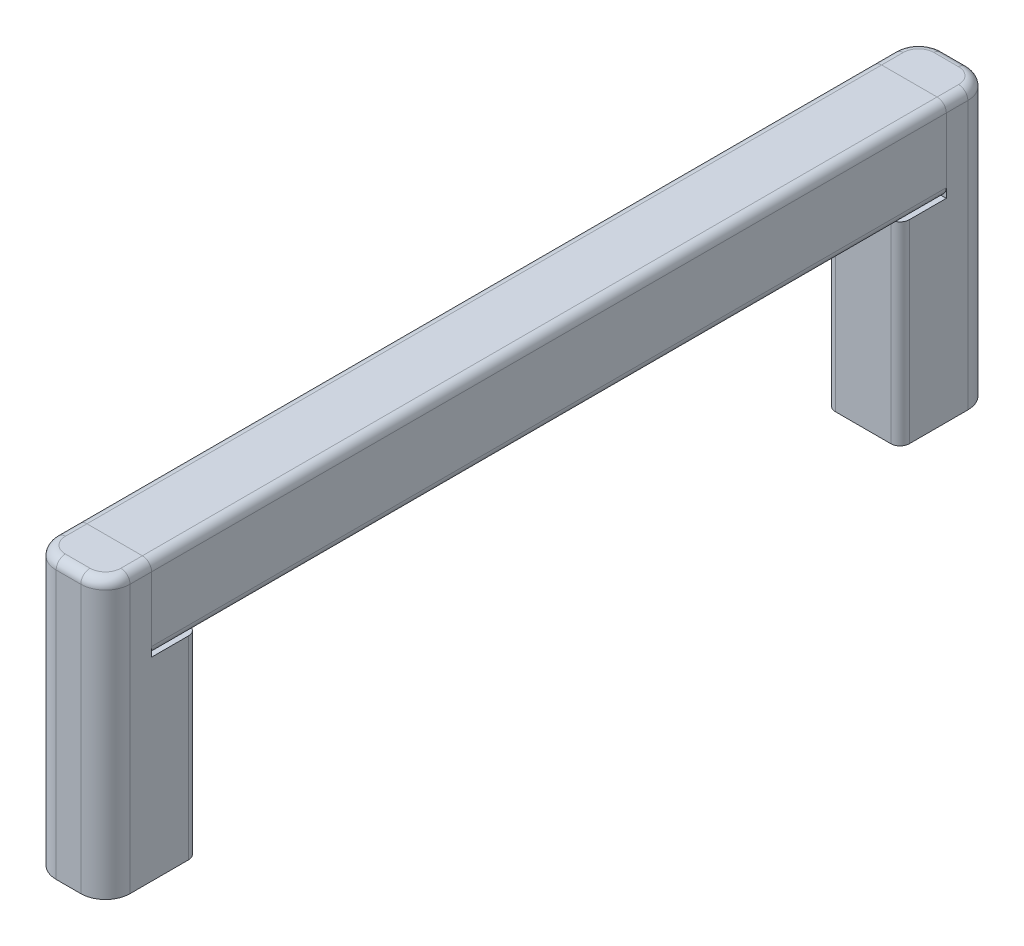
ISO-10303-21;
HEADER;
FILE_DESCRIPTION(('STEP AP214'),'2;1');
FILE_NAME('part.step','',(''),(''),'','','');
FILE_SCHEMA(('AUTOMOTIVE_DESIGN { 1 0 10303 214 1 1 1 1 }'));
ENDSEC;
DATA;
#1=APPLICATION_CONTEXT('core data for automotive mechanical design processes');
#2=APPLICATION_PROTOCOL_DEFINITION('international standard','automotive_design',2000,#1);
#3=PRODUCT_CONTEXT('',#1,'mechanical');
#4=PRODUCT('Part','Part','',(#3));
#5=PRODUCT_RELATED_PRODUCT_CATEGORY('part','',(#4));
#6=PRODUCT_DEFINITION_FORMATION('','',#4);
#7=PRODUCT_DEFINITION_CONTEXT('part definition',#1,'design');
#8=PRODUCT_DEFINITION('design','',#6,#7);
#9=PRODUCT_DEFINITION_SHAPE('','',#8);
#10=(LENGTH_UNIT() NAMED_UNIT(*) SI_UNIT(.MILLI.,.METRE.));
#11=(NAMED_UNIT(*) PLANE_ANGLE_UNIT() SI_UNIT($,.RADIAN.));
#12=(NAMED_UNIT(*) SI_UNIT($,.STERADIAN.) SOLID_ANGLE_UNIT());
#13=UNCERTAINTY_MEASURE_WITH_UNIT(LENGTH_MEASURE(1.E-05),#10,'distance_accuracy_value','');
#14=(GEOMETRIC_REPRESENTATION_CONTEXT(3) GLOBAL_UNCERTAINTY_ASSIGNED_CONTEXT((#13)) GLOBAL_UNIT_ASSIGNED_CONTEXT((#10,
#11,#12)) REPRESENTATION_CONTEXT('',''));
#15=CARTESIAN_POINT('',(0.,0.,0.));
#16=DIRECTION('',(0.,0.,1.));
#17=DIRECTION('',(1.,0.,0.));
#18=AXIS2_PLACEMENT_3D('',#15,#16,#17);
#19=CARTESIAN_POINT('',(-3.,3.50000000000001,43.));
#20=DIRECTION('',(0.,0.,1.));
#21=DIRECTION('',(1.,0.,0.));
#22=AXIS2_PLACEMENT_3D('',#19,#20,#21);
#23=PLANE('',#22);
#24=CARTESIAN_POINT('',(-3.,3.50000000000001,43.));
#25=DIRECTION('',(0.,0.,1.));
#26=DIRECTION('',(1.,0.,0.));
#27=AXIS2_PLACEMENT_3D('',#24,#25,#26);
#28=CIRCLE('',#27,1.);
#29=CARTESIAN_POINT('',(-3.,4.50000000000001,43.));
#30=VERTEX_POINT('',#29);
#31=CARTESIAN_POINT('',(-4.,3.50000000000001,43.));
#32=VERTEX_POINT('',#31);
#33=EDGE_CURVE('P0_E140',#30,#32,#28,.T.);
#34=ORIENTED_EDGE('',*,*,#33,.T.);
#35=DIRECTION('',(0.,-1.,0.));
#36=VECTOR('',#35,1.);
#37=CARTESIAN_POINT('',(-4.,3.50000000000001,43.));
#38=LINE('',#37,#36);
#39=CARTESIAN_POINT('',(-4.,-3.49999999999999,43.));
#40=VERTEX_POINT('',#39);
#41=EDGE_CURVE('P0_E129',#32,#40,#38,.T.);
#42=ORIENTED_EDGE('',*,*,#41,.T.);
#43=CARTESIAN_POINT('',(-3.,-3.49999999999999,43.));
#44=DIRECTION('',(0.,0.,1.));
#45=DIRECTION('',(1.,0.,0.));
#46=AXIS2_PLACEMENT_3D('',#43,#44,#45);
#47=CIRCLE('',#46,1.);
#48=CARTESIAN_POINT('',(-3.,-4.49999999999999,43.));
#49=VERTEX_POINT('',#48);
#50=EDGE_CURVE('P0_E139',#40,#49,#47,.T.);
#51=ORIENTED_EDGE('',*,*,#50,.T.);
#52=DIRECTION('',(1.,0.,0.));
#53=VECTOR('',#52,1.);
#54=CARTESIAN_POINT('',(-3.,-4.49999999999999,43.));
#55=LINE('',#54,#53);
#56=CARTESIAN_POINT('',(3.,-4.49999999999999,43.));
#57=VERTEX_POINT('',#56);
#58=EDGE_CURVE('P0_E224',#49,#57,#55,.T.);
#59=ORIENTED_EDGE('',*,*,#58,.T.);
#60=CARTESIAN_POINT('',(3.,-3.49999999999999,43.));
#61=DIRECTION('',(0.,0.,1.));
#62=DIRECTION('',(1.,0.,0.));
#63=AXIS2_PLACEMENT_3D('',#60,#61,#62);
#64=CIRCLE('',#63,1.);
#65=CARTESIAN_POINT('',(4.,-3.49999999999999,43.));
#66=VERTEX_POINT('',#65);
#67=EDGE_CURVE('P0_E226',#57,#66,#64,.T.);
#68=ORIENTED_EDGE('',*,*,#67,.T.);
#69=DIRECTION('',(0.,1.,0.));
#70=VECTOR('',#69,1.);
#71=CARTESIAN_POINT('',(4.,3.50000000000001,43.));
#72=LINE('',#71,#70);
#73=CARTESIAN_POINT('',(4.,3.50000000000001,43.));
#74=VERTEX_POINT('',#73);
#75=EDGE_CURVE('P0_E228',#66,#74,#72,.T.);
#76=ORIENTED_EDGE('',*,*,#75,.T.);
#77=CARTESIAN_POINT('',(3.,3.50000000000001,43.));
#78=DIRECTION('',(0.,0.,1.));
#79=DIRECTION('',(-1.,0.,0.));
#80=AXIS2_PLACEMENT_3D('',#77,#78,#79);
#81=CIRCLE('',#80,1.);
#82=CARTESIAN_POINT('',(3.,4.50000000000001,43.));
#83=VERTEX_POINT('',#82);
#84=EDGE_CURVE('P0_E230',#74,#83,#81,.T.);
#85=ORIENTED_EDGE('',*,*,#84,.T.);
#86=DIRECTION('',(-1.,0.,0.));
#87=VECTOR('',#86,1.);
#88=CARTESIAN_POINT('',(-3.,4.50000000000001,43.));
#89=LINE('',#88,#87);
#90=EDGE_CURVE('P0_E144',#83,#30,#89,.T.);
#91=ORIENTED_EDGE('',*,*,#90,.T.);
#92=EDGE_LOOP('',(#34,#42,#51,#59,#68,#76,#85,#91));
#93=FACE_BOUND('',#92,.T.);
#94=DIRECTION('',(-1.,0.,0.));
#95=VECTOR('',#94,1.);
#96=CARTESIAN_POINT('',(-1.33333333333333,1.5,43.));
#97=LINE('',#96,#95);
#98=CARTESIAN_POINT('',(0.833333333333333,1.5,43.));
#99=VERTEX_POINT('',#98);
#100=CARTESIAN_POINT('',(-0.833333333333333,1.5,43.));
#101=VERTEX_POINT('',#100);
#102=EDGE_CURVE('P0_E206',#99,#101,#97,.T.);
#103=ORIENTED_EDGE('',*,*,#102,.F.);
#104=CARTESIAN_POINT('',(0.833333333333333,1.,43.));
#105=DIRECTION('',(0.,0.,1.));
#106=DIRECTION('',(1.,0.,0.));
#107=AXIS2_PLACEMENT_3D('',#104,#105,#106);
#108=CIRCLE('',#107,0.5);
#109=CARTESIAN_POINT('',(1.33333333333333,1.,43.));
#110=VERTEX_POINT('',#109);
#111=EDGE_CURVE('P0_E187',#99,#110,#108,.F.);
#112=ORIENTED_EDGE('',*,*,#111,.T.);
#113=DIRECTION('',(0.,1.,0.));
#114=VECTOR('',#113,1.);
#115=CARTESIAN_POINT('',(1.33333333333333,-1.5,43.));
#116=LINE('',#115,#114);
#117=CARTESIAN_POINT('',(1.33333333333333,-0.999999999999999,43.));
#118=VERTEX_POINT('',#117);
#119=EDGE_CURVE('P0_E209',#118,#110,#116,.T.);
#120=ORIENTED_EDGE('',*,*,#119,.F.);
#121=CARTESIAN_POINT('',(0.833333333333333,-0.999999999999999,43.));
#122=DIRECTION('',(0.,0.,1.));
#123=DIRECTION('',(1.,0.,0.));
#124=AXIS2_PLACEMENT_3D('',#121,#122,#123);
#125=CIRCLE('',#124,0.5);
#126=CARTESIAN_POINT('',(0.833333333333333,-1.5,43.));
#127=VERTEX_POINT('',#126);
#128=EDGE_CURVE('P0_E183',#118,#127,#125,.F.);
#129=ORIENTED_EDGE('',*,*,#128,.T.);
#130=DIRECTION('',(1.,0.,0.));
#131=VECTOR('',#130,1.);
#132=CARTESIAN_POINT('',(-1.33333333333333,-1.5,43.));
#133=LINE('',#132,#131);
#134=CARTESIAN_POINT('',(-0.833333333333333,-1.5,43.));
#135=VERTEX_POINT('',#134);
#136=EDGE_CURVE('P0_E211',#135,#127,#133,.T.);
#137=ORIENTED_EDGE('',*,*,#136,.F.);
#138=CARTESIAN_POINT('',(-0.833333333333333,-0.999999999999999,43.));
#139=DIRECTION('',(0.,0.,1.));
#140=DIRECTION('',(1.,0.,0.));
#141=AXIS2_PLACEMENT_3D('',#138,#139,#140);
#142=CIRCLE('',#141,0.5);
#143=CARTESIAN_POINT('',(-1.33333333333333,-0.999999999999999,43.));
#144=VERTEX_POINT('',#143);
#145=EDGE_CURVE('P0_E179',#135,#144,#142,.F.);
#146=ORIENTED_EDGE('',*,*,#145,.T.);
#147=DIRECTION('',(0.,-1.,0.));
#148=VECTOR('',#147,1.);
#149=CARTESIAN_POINT('',(-1.33333333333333,-1.5,43.));
#150=LINE('',#149,#148);
#151=CARTESIAN_POINT('',(-1.33333333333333,1.,43.));
#152=VERTEX_POINT('',#151);
#153=EDGE_CURVE('P0_E208',#152,#144,#150,.T.);
#154=ORIENTED_EDGE('',*,*,#153,.F.);
#155=CARTESIAN_POINT('',(-0.833333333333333,0.999999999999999,43.));
#156=DIRECTION('',(0.,0.,1.));
#157=DIRECTION('',(1.,0.,0.));
#158=AXIS2_PLACEMENT_3D('',#155,#156,#157);
#159=CIRCLE('',#158,0.5);
#160=EDGE_CURVE('P0_E11',#152,#101,#159,.F.);
#161=ORIENTED_EDGE('',*,*,#160,.T.);
#162=EDGE_LOOP('',(#103,#112,#120,#129,#137,#146,#154,#161));
#163=FACE_BOUND('',#162,.T.);
#164=ADVANCED_FACE('P0_F16',(#93,#163),#23,.T.);
#165=CARTESIAN_POINT('',(-3.,3.50000000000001,-43.));
#166=DIRECTION('',(0.,0.,1.));
#167=DIRECTION('',(1.,0.,0.));
#168=AXIS2_PLACEMENT_3D('',#165,#166,#167);
#169=PLANE('',#168);
#170=CARTESIAN_POINT('',(-3.,3.50000000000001,-43.));
#171=DIRECTION('',(0.,0.,1.));
#172=DIRECTION('',(1.,0.,0.));
#173=AXIS2_PLACEMENT_3D('',#170,#171,#172);
#174=CIRCLE('',#173,1.);
#175=CARTESIAN_POINT('',(-3.,4.50000000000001,-43.));
#176=VERTEX_POINT('',#175);
#177=CARTESIAN_POINT('',(-4.,3.50000000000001,-43.));
#178=VERTEX_POINT('',#177);
#179=EDGE_CURVE('P0_E152',#176,#178,#174,.T.);
#180=ORIENTED_EDGE('',*,*,#179,.F.);
#181=DIRECTION('',(-1.,0.,0.));
#182=VECTOR('',#181,1.);
#183=CARTESIAN_POINT('',(-3.,4.50000000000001,-43.));
#184=LINE('',#183,#182);
#185=CARTESIAN_POINT('',(3.,4.50000000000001,-43.));
#186=VERTEX_POINT('',#185);
#187=EDGE_CURVE('P0_E148',#186,#176,#184,.T.);
#188=ORIENTED_EDGE('',*,*,#187,.F.);
#189=CARTESIAN_POINT('',(3.,3.50000000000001,-43.));
#190=DIRECTION('',(0.,0.,1.));
#191=DIRECTION('',(-1.,0.,0.));
#192=AXIS2_PLACEMENT_3D('',#189,#190,#191);
#193=CIRCLE('',#192,1.);
#194=CARTESIAN_POINT('',(4.,3.50000000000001,-43.));
#195=VERTEX_POINT('',#194);
#196=EDGE_CURVE('P0_E245',#195,#186,#193,.T.);
#197=ORIENTED_EDGE('',*,*,#196,.F.);
#198=DIRECTION('',(0.,1.,0.));
#199=VECTOR('',#198,1.);
#200=CARTESIAN_POINT('',(4.,3.50000000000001,-43.));
#201=LINE('',#200,#199);
#202=CARTESIAN_POINT('',(4.,-3.49999999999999,-43.));
#203=VERTEX_POINT('',#202);
#204=EDGE_CURVE('P0_E243',#203,#195,#201,.T.);
#205=ORIENTED_EDGE('',*,*,#204,.F.);
#206=CARTESIAN_POINT('',(3.,-3.49999999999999,-43.));
#207=DIRECTION('',(0.,0.,1.));
#208=DIRECTION('',(1.,0.,0.));
#209=AXIS2_PLACEMENT_3D('',#206,#207,#208);
#210=CIRCLE('',#209,1.);
#211=CARTESIAN_POINT('',(3.,-4.49999999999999,-43.));
#212=VERTEX_POINT('',#211);
#213=EDGE_CURVE('P0_E241',#212,#203,#210,.T.);
#214=ORIENTED_EDGE('',*,*,#213,.F.);
#215=DIRECTION('',(1.,0.,0.));
#216=VECTOR('',#215,1.);
#217=CARTESIAN_POINT('',(-3.,-4.49999999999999,-43.));
#218=LINE('',#217,#216);
#219=CARTESIAN_POINT('',(-3.,-4.49999999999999,-43.));
#220=VERTEX_POINT('',#219);
#221=EDGE_CURVE('P0_E239',#220,#212,#218,.T.);
#222=ORIENTED_EDGE('',*,*,#221,.F.);
#223=CARTESIAN_POINT('',(-3.,-3.49999999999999,-43.));
#224=DIRECTION('',(0.,0.,1.));
#225=DIRECTION('',(1.,0.,0.));
#226=AXIS2_PLACEMENT_3D('',#223,#224,#225);
#227=CIRCLE('',#226,1.);
#228=CARTESIAN_POINT('',(-4.,-3.49999999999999,-43.));
#229=VERTEX_POINT('',#228);
#230=EDGE_CURVE('P0_E237',#229,#220,#227,.T.);
#231=ORIENTED_EDGE('',*,*,#230,.F.);
#232=DIRECTION('',(0.,-1.,0.));
#233=VECTOR('',#232,1.);
#234=CARTESIAN_POINT('',(-4.,3.50000000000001,-43.));
#235=LINE('',#234,#233);
#236=EDGE_CURVE('P0_E235',#178,#229,#235,.T.);
#237=ORIENTED_EDGE('',*,*,#236,.F.);
#238=EDGE_LOOP('',(#180,#188,#197,#205,#214,#222,#231,#237));
#239=FACE_BOUND('',#238,.T.);
#240=DIRECTION('',(1.,0.,0.));
#241=VECTOR('',#240,1.);
#242=CARTESIAN_POINT('',(-1.33333333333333,-1.5,-43.));
#243=LINE('',#242,#241);
#244=CARTESIAN_POINT('',(-0.833333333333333,-1.5,-43.));
#245=VERTEX_POINT('',#244);
#246=CARTESIAN_POINT('',(0.833333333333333,-1.5,-43.));
#247=VERTEX_POINT('',#246);
#248=EDGE_CURVE('P0_E203',#245,#247,#243,.T.);
#249=ORIENTED_EDGE('',*,*,#248,.T.);
#250=CARTESIAN_POINT('',(0.833333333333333,-0.999999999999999,-43.));
#251=DIRECTION('',(0.,0.,1.));
#252=DIRECTION('',(1.,0.,0.));
#253=AXIS2_PLACEMENT_3D('',#250,#251,#252);
#254=CIRCLE('',#253,0.5);
#255=CARTESIAN_POINT('',(1.33333333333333,-0.999999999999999,-43.));
#256=VERTEX_POINT('',#255);
#257=EDGE_CURVE('P0_E181',#247,#256,#254,.T.);
#258=ORIENTED_EDGE('',*,*,#257,.T.);
#259=DIRECTION('',(0.,1.,0.));
#260=VECTOR('',#259,1.);
#261=CARTESIAN_POINT('',(1.33333333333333,-1.5,-43.));
#262=LINE('',#261,#260);
#263=CARTESIAN_POINT('',(1.33333333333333,1.,-43.));
#264=VERTEX_POINT('',#263);
#265=EDGE_CURVE('P0_E218',#256,#264,#262,.T.);
#266=ORIENTED_EDGE('',*,*,#265,.T.);
#267=CARTESIAN_POINT('',(0.833333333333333,1.,-43.));
#268=DIRECTION('',(0.,0.,1.));
#269=DIRECTION('',(1.,0.,0.));
#270=AXIS2_PLACEMENT_3D('',#267,#268,#269);
#271=CIRCLE('',#270,0.5);
#272=CARTESIAN_POINT('',(0.833333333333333,1.5,-43.));
#273=VERTEX_POINT('',#272);
#274=EDGE_CURVE('P0_E185',#264,#273,#271,.T.);
#275=ORIENTED_EDGE('',*,*,#274,.T.);
#276=DIRECTION('',(-1.,0.,0.));
#277=VECTOR('',#276,1.);
#278=CARTESIAN_POINT('',(-1.33333333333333,1.5,-43.));
#279=LINE('',#278,#277);
#280=CARTESIAN_POINT('',(-0.833333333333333,1.5,-43.));
#281=VERTEX_POINT('',#280);
#282=EDGE_CURVE('P0_E195',#273,#281,#279,.T.);
#283=ORIENTED_EDGE('',*,*,#282,.T.);
#284=CARTESIAN_POINT('',(-0.833333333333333,0.999999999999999,-43.));
#285=DIRECTION('',(0.,0.,1.));
#286=DIRECTION('',(1.,0.,0.));
#287=AXIS2_PLACEMENT_3D('',#284,#285,#286);
#288=CIRCLE('',#287,0.5);
#289=CARTESIAN_POINT('',(-1.33333333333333,1.,-43.));
#290=VERTEX_POINT('',#289);
#291=EDGE_CURVE('P0_E24',#281,#290,#288,.T.);
#292=ORIENTED_EDGE('',*,*,#291,.T.);
#293=DIRECTION('',(0.,-1.,0.));
#294=VECTOR('',#293,1.);
#295=CARTESIAN_POINT('',(-1.33333333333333,-1.5,-43.));
#296=LINE('',#295,#294);
#297=CARTESIAN_POINT('',(-1.33333333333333,-0.999999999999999,-43.));
#298=VERTEX_POINT('',#297);
#299=EDGE_CURVE('P0_E194',#290,#298,#296,.T.);
#300=ORIENTED_EDGE('',*,*,#299,.T.);
#301=CARTESIAN_POINT('',(-0.833333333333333,-0.999999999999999,-43.));
#302=DIRECTION('',(0.,0.,1.));
#303=DIRECTION('',(1.,0.,0.));
#304=AXIS2_PLACEMENT_3D('',#301,#302,#303);
#305=CIRCLE('',#304,0.5);
#306=EDGE_CURVE('P0_E177',#298,#245,#305,.T.);
#307=ORIENTED_EDGE('',*,*,#306,.T.);
#308=EDGE_LOOP('',(#249,#258,#266,#275,#283,#292,#300,#307));
#309=FACE_BOUND('',#308,.T.);
#310=ADVANCED_FACE('P0_F193',(#239,#309),#169,.F.);
#311=CARTESIAN_POINT('',(-3.,3.50000000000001,43.));
#312=DIRECTION('',(0.,0.,-1.));
#313=DIRECTION('',(-1.,0.,0.));
#314=AXIS2_PLACEMENT_3D('',#311,#312,#313);
#315=CYLINDRICAL_SURFACE('',#314,1.);
#316=ORIENTED_EDGE('',*,*,#179,.T.);
#317=DIRECTION('',(0.,0.,-1.));
#318=VECTOR('',#317,1.);
#319=CARTESIAN_POINT('',(-4.,3.50000000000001,43.));
#320=LINE('',#319,#318);
#321=EDGE_CURVE('P0_E133',#32,#178,#320,.T.);
#322=ORIENTED_EDGE('',*,*,#321,.F.);
#323=ORIENTED_EDGE('',*,*,#33,.F.);
#324=DIRECTION('',(0.,0.,-1.));
#325=VECTOR('',#324,1.);
#326=CARTESIAN_POINT('',(-3.,4.50000000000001,43.));
#327=LINE('',#326,#325);
#328=EDGE_CURVE('P0_E233',#30,#176,#327,.T.);
#329=ORIENTED_EDGE('',*,*,#328,.T.);
#330=EDGE_LOOP('',(#316,#322,#323,#329));
#331=FACE_BOUND('',#330,.T.);
#332=ADVANCED_FACE('P0_F150',(#331),#315,.T.);
#333=CARTESIAN_POINT('',(-4.,3.50000000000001,43.));
#334=DIRECTION('',(1.,0.,0.));
#335=DIRECTION('',(0.,0.,-1.));
#336=AXIS2_PLACEMENT_3D('',#333,#334,#335);
#337=PLANE('',#336);
#338=ORIENTED_EDGE('',*,*,#236,.T.);
#339=DIRECTION('',(0.,0.,-1.));
#340=VECTOR('',#339,1.);
#341=CARTESIAN_POINT('',(-4.,-3.49999999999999,43.));
#342=LINE('',#341,#340);
#343=EDGE_CURVE('P0_E136',#40,#229,#342,.T.);
#344=ORIENTED_EDGE('',*,*,#343,.F.);
#345=ORIENTED_EDGE('',*,*,#41,.F.);
#346=ORIENTED_EDGE('',*,*,#321,.T.);
#347=EDGE_LOOP('',(#338,#344,#345,#346));
#348=FACE_BOUND('',#347,.T.);
#349=ADVANCED_FACE('P0_F131',(#348),#337,.F.);
#350=CARTESIAN_POINT('',(-3.,-3.49999999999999,43.));
#351=DIRECTION('',(0.,0.,-1.));
#352=DIRECTION('',(-1.,0.,0.));
#353=AXIS2_PLACEMENT_3D('',#350,#351,#352);
#354=CYLINDRICAL_SURFACE('',#353,1.);
#355=ORIENTED_EDGE('',*,*,#230,.T.);
#356=DIRECTION('',(0.,0.,-1.));
#357=VECTOR('',#356,1.);
#358=CARTESIAN_POINT('',(-3.,-4.49999999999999,43.));
#359=LINE('',#358,#357);
#360=EDGE_CURVE('P0_E157',#49,#220,#359,.T.);
#361=ORIENTED_EDGE('',*,*,#360,.F.);
#362=ORIENTED_EDGE('',*,*,#50,.F.);
#363=ORIENTED_EDGE('',*,*,#343,.T.);
#364=EDGE_LOOP('',(#355,#361,#362,#363));
#365=FACE_BOUND('',#364,.T.);
#366=ADVANCED_FACE('P0_F283',(#365),#354,.T.);
#367=CARTESIAN_POINT('',(-3.,-4.49999999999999,43.));
#368=DIRECTION('',(0.,1.,0.));
#369=DIRECTION('',(0.,0.,1.));
#370=AXIS2_PLACEMENT_3D('',#367,#368,#369);
#371=PLANE('',#370);
#372=ORIENTED_EDGE('',*,*,#221,.T.);
#373=DIRECTION('',(0.,0.,-1.));
#374=VECTOR('',#373,1.);
#375=CARTESIAN_POINT('',(3.,-4.49999999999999,43.));
#376=LINE('',#375,#374);
#377=EDGE_CURVE('P0_E258',#57,#212,#376,.T.);
#378=ORIENTED_EDGE('',*,*,#377,.F.);
#379=ORIENTED_EDGE('',*,*,#58,.F.);
#380=ORIENTED_EDGE('',*,*,#360,.T.);
#381=EDGE_LOOP('',(#372,#378,#379,#380));
#382=FACE_BOUND('',#381,.T.);
#383=ADVANCED_FACE('P0_F265',(#382),#371,.F.);
#384=CARTESIAN_POINT('',(3.,-3.49999999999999,43.));
#385=DIRECTION('',(0.,0.,-1.));
#386=DIRECTION('',(-1.,0.,0.));
#387=AXIS2_PLACEMENT_3D('',#384,#385,#386);
#388=CYLINDRICAL_SURFACE('',#387,1.);
#389=ORIENTED_EDGE('',*,*,#213,.T.);
#390=DIRECTION('',(0.,0.,-1.));
#391=VECTOR('',#390,1.);
#392=CARTESIAN_POINT('',(4.,-3.49999999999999,43.));
#393=LINE('',#392,#391);
#394=EDGE_CURVE('P0_E255',#66,#203,#393,.T.);
#395=ORIENTED_EDGE('',*,*,#394,.F.);
#396=ORIENTED_EDGE('',*,*,#67,.F.);
#397=ORIENTED_EDGE('',*,*,#377,.T.);
#398=EDGE_LOOP('',(#389,#395,#396,#397));
#399=FACE_BOUND('',#398,.T.);
#400=ADVANCED_FACE('P0_F275',(#399),#388,.T.);
#401=CARTESIAN_POINT('',(4.,3.50000000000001,43.));
#402=DIRECTION('',(-1.,0.,0.));
#403=DIRECTION('',(0.,0.,1.));
#404=AXIS2_PLACEMENT_3D('',#401,#402,#403);
#405=PLANE('',#404);
#406=ORIENTED_EDGE('',*,*,#204,.T.);
#407=DIRECTION('',(0.,0.,-1.));
#408=VECTOR('',#407,1.);
#409=CARTESIAN_POINT('',(4.,3.50000000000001,43.));
#410=LINE('',#409,#408);
#411=EDGE_CURVE('P0_E252',#74,#195,#410,.T.);
#412=ORIENTED_EDGE('',*,*,#411,.F.);
#413=ORIENTED_EDGE('',*,*,#75,.F.);
#414=ORIENTED_EDGE('',*,*,#394,.T.);
#415=EDGE_LOOP('',(#406,#412,#413,#414));
#416=FACE_BOUND('',#415,.T.);
#417=ADVANCED_FACE('P0_F279',(#416),#405,.F.);
#418=CARTESIAN_POINT('',(3.,3.50000000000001,43.));
#419=DIRECTION('',(0.,0.,-1.));
#420=DIRECTION('',(-1.,0.,0.));
#421=AXIS2_PLACEMENT_3D('',#418,#419,#420);
#422=CYLINDRICAL_SURFACE('',#421,1.);
#423=ORIENTED_EDGE('',*,*,#196,.T.);
#424=DIRECTION('',(0.,0.,-1.));
#425=VECTOR('',#424,1.);
#426=CARTESIAN_POINT('',(3.,4.50000000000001,43.));
#427=LINE('',#426,#425);
#428=EDGE_CURVE('P0_E249',#83,#186,#427,.T.);
#429=ORIENTED_EDGE('',*,*,#428,.F.);
#430=ORIENTED_EDGE('',*,*,#84,.F.);
#431=ORIENTED_EDGE('',*,*,#411,.T.);
#432=EDGE_LOOP('',(#423,#429,#430,#431));
#433=FACE_BOUND('',#432,.T.);
#434=ADVANCED_FACE('P0_F306',(#433),#422,.T.);
#435=CARTESIAN_POINT('',(-3.,4.50000000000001,43.));
#436=DIRECTION('',(0.,-1.,0.));
#437=DIRECTION('',(0.,0.,-1.));
#438=AXIS2_PLACEMENT_3D('',#435,#436,#437);
#439=PLANE('',#438);
#440=ORIENTED_EDGE('',*,*,#187,.T.);
#441=ORIENTED_EDGE('',*,*,#328,.F.);
#442=ORIENTED_EDGE('',*,*,#90,.F.);
#443=ORIENTED_EDGE('',*,*,#428,.T.);
#444=EDGE_LOOP('',(#440,#441,#442,#443));
#445=FACE_BOUND('',#444,.T.);
#446=ADVANCED_FACE('P0_F303',(#445),#439,.F.);
#447=CARTESIAN_POINT('',(1.33333333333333,-1.5,43.));
#448=DIRECTION('',(-1.,0.,0.));
#449=DIRECTION('',(0.,0.,1.));
#450=AXIS2_PLACEMENT_3D('',#447,#448,#449);
#451=PLANE('',#450);
#452=ORIENTED_EDGE('',*,*,#265,.F.);
#453=DIRECTION('',(0.,0.,-1.));
#454=VECTOR('',#453,1.);
#455=CARTESIAN_POINT('',(1.33333333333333,-0.999999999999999,43.));
#456=LINE('',#455,#454);
#457=EDGE_CURVE('P0_E171',#256,#118,#456,.F.);
#458=ORIENTED_EDGE('',*,*,#457,.T.);
#459=ORIENTED_EDGE('',*,*,#119,.T.);
#460=DIRECTION('',(0.,0.,-1.));
#461=VECTOR('',#460,1.);
#462=CARTESIAN_POINT('',(1.33333333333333,1.,-43.));
#463=LINE('',#462,#461);
#464=EDGE_CURVE('P0_E168',#110,#264,#463,.T.);
#465=ORIENTED_EDGE('',*,*,#464,.T.);
#466=EDGE_LOOP('',(#452,#458,#459,#465));
#467=FACE_BOUND('',#466,.T.);
#468=ADVANCED_FACE('P0_F300',(#467),#451,.T.);
#469=CARTESIAN_POINT('',(-1.33333333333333,1.5,43.));
#470=DIRECTION('',(0.,-1.,0.));
#471=DIRECTION('',(1.,0.,0.));
#472=AXIS2_PLACEMENT_3D('',#469,#470,#471);
#473=PLANE('',#472);
#474=ORIENTED_EDGE('',*,*,#282,.F.);
#475=DIRECTION('',(0.,0.,-1.));
#476=VECTOR('',#475,1.);
#477=CARTESIAN_POINT('',(0.833333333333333,1.5,43.));
#478=LINE('',#477,#476);
#479=EDGE_CURVE('P0_E36',#273,#99,#478,.F.);
#480=ORIENTED_EDGE('',*,*,#479,.T.);
#481=ORIENTED_EDGE('',*,*,#102,.T.);
#482=DIRECTION('',(0.,0.,-1.));
#483=VECTOR('',#482,1.);
#484=CARTESIAN_POINT('',(-0.833333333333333,1.5,-43.));
#485=LINE('',#484,#483);
#486=EDGE_CURVE('P0_E173',#101,#281,#485,.T.);
#487=ORIENTED_EDGE('',*,*,#486,.T.);
#488=EDGE_LOOP('',(#474,#480,#481,#487));
#489=FACE_BOUND('',#488,.T.);
#490=ADVANCED_FACE('P0_F205',(#489),#473,.T.);
#491=CARTESIAN_POINT('',(-1.33333333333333,-1.5,43.));
#492=DIRECTION('',(1.,0.,0.));
#493=DIRECTION('',(0.,0.,-1.));
#494=AXIS2_PLACEMENT_3D('',#491,#492,#493);
#495=PLANE('',#494);
#496=ORIENTED_EDGE('',*,*,#153,.T.);
#497=DIRECTION('',(0.,0.,-1.));
#498=VECTOR('',#497,1.);
#499=CARTESIAN_POINT('',(-1.33333333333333,-0.999999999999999,-43.));
#500=LINE('',#499,#498);
#501=EDGE_CURVE('P0_E155',#144,#298,#500,.T.);
#502=ORIENTED_EDGE('',*,*,#501,.T.);
#503=ORIENTED_EDGE('',*,*,#299,.F.);
#504=DIRECTION('',(0.,0.,-1.));
#505=VECTOR('',#504,1.);
#506=CARTESIAN_POINT('',(-1.33333333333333,0.999999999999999,43.));
#507=LINE('',#506,#505);
#508=EDGE_CURVE('P0_E153',#290,#152,#507,.F.);
#509=ORIENTED_EDGE('',*,*,#508,.T.);
#510=EDGE_LOOP('',(#496,#502,#503,#509));
#511=FACE_BOUND('',#510,.T.);
#512=ADVANCED_FACE('P0_F201',(#511),#495,.T.);
#513=CARTESIAN_POINT('',(-1.33333333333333,-1.5,43.));
#514=DIRECTION('',(0.,1.,0.));
#515=DIRECTION('',(0.,0.,1.));
#516=AXIS2_PLACEMENT_3D('',#513,#514,#515);
#517=PLANE('',#516);
#518=ORIENTED_EDGE('',*,*,#248,.F.);
#519=DIRECTION('',(0.,0.,-1.));
#520=VECTOR('',#519,1.);
#521=CARTESIAN_POINT('',(-0.833333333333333,-1.5,43.));
#522=LINE('',#521,#520);
#523=EDGE_CURVE('P0_E166',#245,#135,#522,.F.);
#524=ORIENTED_EDGE('',*,*,#523,.T.);
#525=ORIENTED_EDGE('',*,*,#136,.T.);
#526=DIRECTION('',(0.,0.,-1.));
#527=VECTOR('',#526,1.);
#528=CARTESIAN_POINT('',(0.833333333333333,-1.5,-43.));
#529=LINE('',#528,#527);
#530=EDGE_CURVE('P0_E163',#127,#247,#529,.T.);
#531=ORIENTED_EDGE('',*,*,#530,.T.);
#532=EDGE_LOOP('',(#518,#524,#525,#531));
#533=FACE_BOUND('',#532,.T.);
#534=ADVANCED_FACE('P0_F355',(#533),#517,.T.);
#535=CARTESIAN_POINT('',(-0.833333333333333,-0.999999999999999,43.));
#536=DIRECTION('',(0.,0.,1.));
#537=DIRECTION('',(1.,0.,0.));
#538=AXIS2_PLACEMENT_3D('',#535,#536,#537);
#539=CYLINDRICAL_SURFACE('',#538,0.5);
#540=ORIENTED_EDGE('',*,*,#145,.F.);
#541=ORIENTED_EDGE('',*,*,#523,.F.);
#542=ORIENTED_EDGE('',*,*,#306,.F.);
#543=ORIENTED_EDGE('',*,*,#501,.F.);
#544=EDGE_LOOP('',(#540,#541,#542,#543));
#545=FACE_BOUND('',#544,.T.);
#546=ADVANCED_FACE('P0_F363',(#545),#539,.F.);
#547=CARTESIAN_POINT('',(0.833333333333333,-0.999999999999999,43.));
#548=DIRECTION('',(0.,0.,1.));
#549=DIRECTION('',(1.,0.,0.));
#550=AXIS2_PLACEMENT_3D('',#547,#548,#549);
#551=CYLINDRICAL_SURFACE('',#550,0.5);
#552=ORIENTED_EDGE('',*,*,#128,.F.);
#553=ORIENTED_EDGE('',*,*,#457,.F.);
#554=ORIENTED_EDGE('',*,*,#257,.F.);
#555=ORIENTED_EDGE('',*,*,#530,.F.);
#556=EDGE_LOOP('',(#552,#553,#554,#555));
#557=FACE_BOUND('',#556,.T.);
#558=ADVANCED_FACE('P0_F372',(#557),#551,.F.);
#559=CARTESIAN_POINT('',(0.833333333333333,1.,43.));
#560=DIRECTION('',(0.,0.,1.));
#561=DIRECTION('',(1.,0.,0.));
#562=AXIS2_PLACEMENT_3D('',#559,#560,#561);
#563=CYLINDRICAL_SURFACE('',#562,0.5);
#564=ORIENTED_EDGE('',*,*,#111,.F.);
#565=ORIENTED_EDGE('',*,*,#479,.F.);
#566=ORIENTED_EDGE('',*,*,#274,.F.);
#567=ORIENTED_EDGE('',*,*,#464,.F.);
#568=EDGE_LOOP('',(#564,#565,#566,#567));
#569=FACE_BOUND('',#568,.T.);
#570=ADVANCED_FACE('P0_F381',(#569),#563,.F.);
#571=CARTESIAN_POINT('',(-0.833333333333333,0.999999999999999,43.));
#572=DIRECTION('',(0.,0.,1.));
#573=DIRECTION('',(1.,0.,0.));
#574=AXIS2_PLACEMENT_3D('',#571,#572,#573);
#575=CYLINDRICAL_SURFACE('',#574,0.5);
#576=ORIENTED_EDGE('',*,*,#160,.F.);
#577=ORIENTED_EDGE('',*,*,#508,.F.);
#578=ORIENTED_EDGE('',*,*,#291,.F.);
#579=ORIENTED_EDGE('',*,*,#486,.F.);
#580=EDGE_LOOP('',(#576,#577,#578,#579));
#581=FACE_BOUND('',#580,.T.);
#582=ADVANCED_FACE('P0_F18',(#581),#575,.F.);
#583=CLOSED_SHELL('',(#164,#310,#332,#349,#366,#383,#400,#417,#434,#446,#468,#490,#512,#534,
#546,#558,#570,#582));
#584=MANIFOLD_SOLID_BREP('P0_B1',#583);
#585=CARTESIAN_POINT('',(0.,-25.5,-43.));
#586=DIRECTION('',(0.,1.,0.));
#587=DIRECTION('',(-1.,0.,0.));
#588=AXIS2_PLACEMENT_3D('',#585,#586,#587);
#589=CYLINDRICAL_SURFACE('',#588,3.24999999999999);
#590=CARTESIAN_POINT('',(0.,-11.2769088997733,-43.));
#591=DIRECTION('',(0.,1.,0.));
#592=DIRECTION('',(-1.,0.,0.));
#593=AXIS2_PLACEMENT_3D('',#590,#591,#592);
#594=CIRCLE('',#593,3.24999999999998);
#595=CARTESIAN_POINT('',(-3.24999999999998,-11.2769088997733,-43.));
#596=VERTEX_POINT('',#595);
#597=EDGE_CURVE('P1_E11',#596,#596,#594,.T.);
#598=ORIENTED_EDGE('',*,*,#597,.F.);
#599=EDGE_LOOP('',(#598));
#600=FACE_BOUND('',#599,.T.);
#601=CARTESIAN_POINT('',(0.,-25.5,-43.));
#602=DIRECTION('',(0.,1.,0.));
#603=DIRECTION('',(-1.,0.,0.));
#604=AXIS2_PLACEMENT_3D('',#601,#602,#603);
#605=CIRCLE('',#604,3.25);
#606=CARTESIAN_POINT('',(-3.25,-25.5,-43.));
#607=VERTEX_POINT('',#606);
#608=EDGE_CURVE('P1_E51',#607,#607,#605,.T.);
#609=ORIENTED_EDGE('',*,*,#608,.T.);
#610=EDGE_LOOP('',(#609));
#611=FACE_BOUND('',#610,.T.);
#612=ADVANCED_FACE('P1_F16',(#600,#611),#589,.T.);
#613=CARTESIAN_POINT('',(0.,-11.2769088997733,-43.));
#614=DIRECTION('',(0.,1.,0.));
#615=DIRECTION('',(-1.,0.,0.));
#616=AXIS2_PLACEMENT_3D('',#613,#614,#615);
#617=TOROIDAL_SURFACE('',#616,2.25,0.999999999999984);
#618=CARTESIAN_POINT('',(0.,-10.2807142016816,-43.));
#619=DIRECTION('',(0.,1.,0.));
#620=DIRECTION('',(-1.,0.,0.));
#621=AXIS2_PLACEMENT_3D('',#618,#619,#620);
#622=CIRCLE('',#621,2.33715574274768);
#623=CARTESIAN_POINT('',(-2.33715574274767,-10.2807142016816,-43.));
#624=VERTEX_POINT('',#623);
#625=EDGE_CURVE('P1_E23',#624,#624,#622,.T.);
#626=ORIENTED_EDGE('',*,*,#625,.F.);
#627=EDGE_LOOP('',(#626));
#628=FACE_BOUND('',#627,.T.);
#629=ORIENTED_EDGE('',*,*,#597,.T.);
#630=EDGE_LOOP('',(#629));
#631=FACE_BOUND('',#630,.T.);
#632=ADVANCED_FACE('P1_F33',(#628,#631),#617,.T.);
#633=CARTESIAN_POINT('',(0.,-10.2807142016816,-43.));
#634=DIRECTION('',(0.,-1.,0.));
#635=DIRECTION('',(1.,0.,0.));
#636=AXIS2_PLACEMENT_3D('',#633,#634,#635);
#637=CONICAL_SURFACE('',#636,2.33715574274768,1.48352986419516);
#638=CARTESIAN_POINT('',(0.,-10.0762395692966,-43.));
#639=VERTEX_POINT('',#638);
#640=VERTEX_LOOP('',#639);
#641=FACE_BOUND('',#640,.T.);
#642=ORIENTED_EDGE('',*,*,#625,.T.);
#643=EDGE_LOOP('',(#642));
#644=FACE_BOUND('',#643,.T.);
#645=ADVANCED_FACE('P1_F29',(#641,#644),#637,.T.);
#646=CARTESIAN_POINT('',(0.,-13.5762395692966,-43.));
#647=DIRECTION('',(0.,-1.,0.));
#648=DIRECTION('',(1.,0.,0.));
#649=AXIS2_PLACEMENT_3D('',#646,#647,#648);
#650=CONICAL_SURFACE('',#649,0.,1.04719755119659);
#651=CARTESIAN_POINT('',(0.,-14.5,-43.));
#652=DIRECTION('',(0.,1.,0.));
#653=DIRECTION('',(-1.,0.,0.));
#654=AXIS2_PLACEMENT_3D('',#651,#652,#653);
#655=CIRCLE('',#654,1.6);
#656=CARTESIAN_POINT('',(-1.6,-14.5,-43.));
#657=VERTEX_POINT('',#656);
#658=EDGE_CURVE('P1_E38',#657,#657,#655,.T.);
#659=ORIENTED_EDGE('',*,*,#658,.F.);
#660=EDGE_LOOP('',(#659));
#661=FACE_BOUND('',#660,.T.);
#662=CARTESIAN_POINT('',(0.,-13.5762395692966,-43.));
#663=VERTEX_POINT('',#662);
#664=VERTEX_LOOP('',#663);
#665=FACE_BOUND('',#664,.T.);
#666=ADVANCED_FACE('P1_F32',(#661,#665),#650,.F.);
#667=CARTESIAN_POINT('',(0.,-25.5,-43.));
#668=DIRECTION('',(0.,1.,0.));
#669=DIRECTION('',(-1.,0.,0.));
#670=AXIS2_PLACEMENT_3D('',#667,#668,#669);
#671=CYLINDRICAL_SURFACE('',#670,1.6);
#672=CARTESIAN_POINT('',(0.,-17.5,-43.));
#673=DIRECTION('',(0.,1.,0.));
#674=DIRECTION('',(-1.,0.,0.));
#675=AXIS2_PLACEMENT_3D('',#672,#673,#674);
#676=CIRCLE('',#675,1.6);
#677=CARTESIAN_POINT('',(-1.6,-17.5,-43.));
#678=VERTEX_POINT('',#677);
#679=EDGE_CURVE('P1_E40',#678,#678,#676,.T.);
#680=ORIENTED_EDGE('',*,*,#679,.F.);
#681=EDGE_LOOP('',(#680));
#682=FACE_BOUND('',#681,.T.);
#683=ORIENTED_EDGE('',*,*,#658,.T.);
#684=EDGE_LOOP('',(#683));
#685=FACE_BOUND('',#684,.T.);
#686=ADVANCED_FACE('P1_F71',(#682,#685),#671,.F.);
#687=CARTESIAN_POINT('',(0.,-17.5,-41.));
#688=DIRECTION('',(0.,1.,0.));
#689=DIRECTION('',(-1.,0.,0.));
#690=AXIS2_PLACEMENT_3D('',#687,#688,#689);
#691=PLANE('',#690);
#692=CARTESIAN_POINT('',(0.,-17.5,-43.));
#693=DIRECTION('',(0.,1.,0.));
#694=DIRECTION('',(-1.,0.,0.));
#695=AXIS2_PLACEMENT_3D('',#692,#693,#694);
#696=CIRCLE('',#695,2.);
#697=CARTESIAN_POINT('',(-2.,-17.5,-43.));
#698=VERTEX_POINT('',#697);
#699=EDGE_CURVE('P1_E45',#698,#698,#696,.T.);
#700=ORIENTED_EDGE('',*,*,#699,.F.);
#701=EDGE_LOOP('',(#700));
#702=FACE_BOUND('',#701,.T.);
#703=ORIENTED_EDGE('',*,*,#679,.T.);
#704=EDGE_LOOP('',(#703));
#705=FACE_BOUND('',#704,.T.);
#706=ADVANCED_FACE('P1_F65',(#702,#705),#691,.F.);
#707=CARTESIAN_POINT('',(0.,-25.5,-43.));
#708=DIRECTION('',(0.,1.,0.));
#709=DIRECTION('',(-1.,0.,0.));
#710=AXIS2_PLACEMENT_3D('',#707,#708,#709);
#711=CYLINDRICAL_SURFACE('',#710,2.);
#712=CARTESIAN_POINT('',(0.,-25.5,-43.));
#713=DIRECTION('',(0.,1.,0.));
#714=DIRECTION('',(-1.,0.,0.));
#715=AXIS2_PLACEMENT_3D('',#712,#713,#714);
#716=CIRCLE('',#715,2.);
#717=CARTESIAN_POINT('',(-2.,-25.5,-43.));
#718=VERTEX_POINT('',#717);
#719=EDGE_CURVE('P1_E48',#718,#718,#716,.T.);
#720=ORIENTED_EDGE('',*,*,#719,.F.);
#721=EDGE_LOOP('',(#720));
#722=FACE_BOUND('',#721,.T.);
#723=ORIENTED_EDGE('',*,*,#699,.T.);
#724=EDGE_LOOP('',(#723));
#725=FACE_BOUND('',#724,.T.);
#726=ADVANCED_FACE('P1_F59',(#722,#725),#711,.F.);
#727=CARTESIAN_POINT('',(0.,-25.5,-41.));
#728=DIRECTION('',(0.,1.,0.));
#729=DIRECTION('',(-1.,0.,0.));
#730=AXIS2_PLACEMENT_3D('',#727,#728,#729);
#731=PLANE('',#730);
#732=ORIENTED_EDGE('',*,*,#608,.F.);
#733=EDGE_LOOP('',(#732));
#734=FACE_BOUND('',#733,.T.);
#735=ORIENTED_EDGE('',*,*,#719,.T.);
#736=EDGE_LOOP('',(#735));
#737=FACE_BOUND('',#736,.T.);
#738=ADVANCED_FACE('P1_F56',(#734,#737),#731,.F.);
#739=CLOSED_SHELL('',(#612,#632,#645,#666,#686,#706,#726,#738));
#740=MANIFOLD_SOLID_BREP('P1_B1',#739);
#741=CARTESIAN_POINT('',(-1.33333333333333,-25.5,-45.3333333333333));
#742=DIRECTION('',(0.,1.,0.));
#743=DIRECTION('',(-1.,0.,0.));
#744=AXIS2_PLACEMENT_3D('',#741,#742,#743);
#745=PLANE('',#744);
#746=DIRECTION('',(0.,0.,-1.));
#747=VECTOR('',#746,1.);
#748=CARTESIAN_POINT('',(4.,-25.5,-45.3333333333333));
#749=LINE('',#748,#747);
#750=CARTESIAN_POINT('',(4.,-25.5,-39.));
#751=VERTEX_POINT('',#750);
#752=CARTESIAN_POINT('',(4.,-25.5,-45.3333333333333));
#753=VERTEX_POINT('',#752);
#754=EDGE_CURVE('P2_E225',#751,#753,#749,.T.);
#755=ORIENTED_EDGE('',*,*,#754,.F.);
#756=CARTESIAN_POINT('',(3.,-25.5,-39.));
#757=DIRECTION('',(0.,1.,0.));
#758=DIRECTION('',(-1.,0.,0.));
#759=AXIS2_PLACEMENT_3D('',#756,#757,#758);
#760=CIRCLE('',#759,1.);
#761=CARTESIAN_POINT('',(3.,-25.5,-38.));
#762=VERTEX_POINT('',#761);
#763=EDGE_CURVE('P2_E276',#751,#762,#760,.F.);
#764=ORIENTED_EDGE('',*,*,#763,.T.);
#765=DIRECTION('',(1.,0.,0.));
#766=VECTOR('',#765,1.);
#767=CARTESIAN_POINT('',(4.,-25.5,-38.));
#768=LINE('',#767,#766);
#769=CARTESIAN_POINT('',(-3.,-25.5,-38.));
#770=VERTEX_POINT('',#769);
#771=EDGE_CURVE('P2_E220',#770,#762,#768,.T.);
#772=ORIENTED_EDGE('',*,*,#771,.F.);
#773=CARTESIAN_POINT('',(-3.,-25.5,-39.));
#774=DIRECTION('',(0.,1.,0.));
#775=DIRECTION('',(-1.,0.,0.));
#776=AXIS2_PLACEMENT_3D('',#773,#774,#775);
#777=CIRCLE('',#776,1.);
#778=CARTESIAN_POINT('',(-4.,-25.5,-39.));
#779=VERTEX_POINT('',#778);
#780=EDGE_CURVE('P2_E274',#770,#779,#777,.F.);
#781=ORIENTED_EDGE('',*,*,#780,.T.);
#782=DIRECTION('',(0.,0.,1.));
#783=VECTOR('',#782,1.);
#784=CARTESIAN_POINT('',(-4.,-25.5,-45.3333333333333));
#785=LINE('',#784,#783);
#786=CARTESIAN_POINT('',(-4.,-25.5,-45.3333333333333));
#787=VERTEX_POINT('',#786);
#788=EDGE_CURVE('P2_E237',#787,#779,#785,.T.);
#789=ORIENTED_EDGE('',*,*,#788,.F.);
#790=CARTESIAN_POINT('',(-1.33333333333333,-25.5,-45.3333333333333));
#791=DIRECTION('',(0.,1.,0.));
#792=DIRECTION('',(-1.,0.,0.));
#793=AXIS2_PLACEMENT_3D('',#790,#791,#792);
#794=CIRCLE('',#793,2.66666666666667);
#795=CARTESIAN_POINT('',(-1.33333333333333,-25.5,-48.));
#796=VERTEX_POINT('',#795);
#797=EDGE_CURVE('P2_E234',#796,#787,#794,.T.);
#798=ORIENTED_EDGE('',*,*,#797,.F.);
#799=DIRECTION('',(-1.,0.,0.));
#800=VECTOR('',#799,1.);
#801=CARTESIAN_POINT('',(1.33333333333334,-25.5,-48.));
#802=LINE('',#801,#800);
#803=CARTESIAN_POINT('',(1.33333333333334,-25.5,-48.));
#804=VERTEX_POINT('',#803);
#805=EDGE_CURVE('P2_E231',#804,#796,#802,.T.);
#806=ORIENTED_EDGE('',*,*,#805,.F.);
#807=CARTESIAN_POINT('',(1.33333333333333,-25.5,-45.3333333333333));
#808=DIRECTION('',(0.,1.,0.));
#809=DIRECTION('',(-1.,0.,0.));
#810=AXIS2_PLACEMENT_3D('',#807,#808,#809);
#811=CIRCLE('',#810,2.66666666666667);
#812=EDGE_CURVE('P2_E228',#753,#804,#811,.T.);
#813=ORIENTED_EDGE('',*,*,#812,.F.);
#814=EDGE_LOOP('',(#755,#764,#772,#781,#789,#798,#806,#813));
#815=FACE_BOUND('',#814,.T.);
#816=CARTESIAN_POINT('',(0.,-25.5,-43.));
#817=DIRECTION('',(0.,1.,0.));
#818=DIRECTION('',(0.,0.,-1.));
#819=AXIS2_PLACEMENT_3D('',#816,#817,#818);
#820=CIRCLE('',#819,3.25);
#821=CARTESIAN_POINT('',(0.,-25.5,-46.25));
#822=VERTEX_POINT('',#821);
#823=EDGE_CURVE('P2_E172',#822,#822,#820,.T.);
#824=ORIENTED_EDGE('',*,*,#823,.T.);
#825=EDGE_LOOP('',(#824));
#826=FACE_BOUND('',#825,.T.);
#827=ADVANCED_FACE('P2_F16',(#815,#826),#745,.F.);
#828=CARTESIAN_POINT('',(4.,-4.5,-43.));
#829=DIRECTION('',(0.,0.,-1.));
#830=DIRECTION('',(-1.,0.,0.));
#831=AXIS2_PLACEMENT_3D('',#828,#829,#830);
#832=PLANE('',#831);
#833=DIRECTION('',(0.,1.,0.));
#834=VECTOR('',#833,1.);
#835=CARTESIAN_POINT('',(4.,-4.5,-43.));
#836=LINE('',#835,#834);
#837=CARTESIAN_POINT('',(4.,-4.5,-43.));
#838=VERTEX_POINT('',#837);
#839=CARTESIAN_POINT('',(4.,3.5,-43.));
#840=VERTEX_POINT('',#839);
#841=EDGE_CURVE('P2_E217',#838,#840,#836,.T.);
#842=ORIENTED_EDGE('',*,*,#841,.T.);
#843=CARTESIAN_POINT('',(3.,3.5,-43.));
#844=DIRECTION('',(0.,0.,-1.));
#845=DIRECTION('',(-1.,0.,0.));
#846=AXIS2_PLACEMENT_3D('',#843,#844,#845);
#847=CIRCLE('',#846,1.);
#848=CARTESIAN_POINT('',(3.,4.5,-43.));
#849=VERTEX_POINT('',#848);
#850=EDGE_CURVE('P2_E266',#840,#849,#847,.F.);
#851=ORIENTED_EDGE('',*,*,#850,.T.);
#852=DIRECTION('',(-1.,0.,0.));
#853=VECTOR('',#852,1.);
#854=CARTESIAN_POINT('',(4.,4.5,-43.));
#855=LINE('',#854,#853);
#856=CARTESIAN_POINT('',(-3.,4.5,-43.));
#857=VERTEX_POINT('',#856);
#858=EDGE_CURVE('P2_E191',#849,#857,#855,.T.);
#859=ORIENTED_EDGE('',*,*,#858,.T.);
#860=CARTESIAN_POINT('',(-3.,3.5,-43.));
#861=DIRECTION('',(0.,0.,-1.));
#862=DIRECTION('',(-1.,0.,0.));
#863=AXIS2_PLACEMENT_3D('',#860,#861,#862);
#864=CIRCLE('',#863,1.);
#865=CARTESIAN_POINT('',(-4.,3.5,-43.));
#866=VERTEX_POINT('',#865);
#867=EDGE_CURVE('P2_E264',#857,#866,#864,.F.);
#868=ORIENTED_EDGE('',*,*,#867,.T.);
#869=DIRECTION('',(0.,1.,0.));
#870=VECTOR('',#869,1.);
#871=CARTESIAN_POINT('',(-4.,-4.5,-43.));
#872=LINE('',#871,#870);
#873=CARTESIAN_POINT('',(-4.,-4.5,-43.));
#874=VERTEX_POINT('',#873);
#875=EDGE_CURVE('P2_E214',#874,#866,#872,.T.);
#876=ORIENTED_EDGE('',*,*,#875,.F.);
#877=DIRECTION('',(-1.,0.,0.));
#878=VECTOR('',#877,1.);
#879=CARTESIAN_POINT('',(4.,-4.5,-43.));
#880=LINE('',#879,#878);
#881=EDGE_CURVE('P2_E203',#838,#874,#880,.T.);
#882=ORIENTED_EDGE('',*,*,#881,.F.);
#883=EDGE_LOOP('',(#842,#851,#859,#868,#876,#882));
#884=FACE_BOUND('',#883,.T.);
#885=DIRECTION('',(0.,-1.,0.));
#886=VECTOR('',#885,1.);
#887=CARTESIAN_POINT('',(-1.33333333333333,1.5,-43.));
#888=LINE('',#887,#886);
#889=CARTESIAN_POINT('',(-1.33333333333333,0.999999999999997,-43.));
#890=VERTEX_POINT('',#889);
#891=CARTESIAN_POINT('',(-1.33333333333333,-1.,-43.));
#892=VERTEX_POINT('',#891);
#893=EDGE_CURVE('P2_E192',#890,#892,#888,.T.);
#894=ORIENTED_EDGE('',*,*,#893,.F.);
#895=CARTESIAN_POINT('',(-0.833333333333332,0.999999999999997,-43.));
#896=DIRECTION('',(0.,0.,-1.));
#897=DIRECTION('',(-1.,0.,0.));
#898=AXIS2_PLACEMENT_3D('',#895,#896,#897);
#899=CIRCLE('',#898,0.5);
#900=CARTESIAN_POINT('',(-0.833333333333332,1.5,-43.));
#901=VERTEX_POINT('',#900);
#902=EDGE_CURVE('P2_E11',#890,#901,#899,.T.);
#903=ORIENTED_EDGE('',*,*,#902,.T.);
#904=DIRECTION('',(-1.,0.,0.));
#905=VECTOR('',#904,1.);
#906=CARTESIAN_POINT('',(-1.33333333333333,1.5,-43.));
#907=LINE('',#906,#905);
#908=CARTESIAN_POINT('',(0.833333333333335,1.5,-43.));
#909=VERTEX_POINT('',#908);
#910=EDGE_CURVE('P2_E182',#909,#901,#907,.T.);
#911=ORIENTED_EDGE('',*,*,#910,.F.);
#912=CARTESIAN_POINT('',(0.833333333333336,0.999999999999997,-43.));
#913=DIRECTION('',(0.,0.,-1.));
#914=DIRECTION('',(-1.,0.,0.));
#915=AXIS2_PLACEMENT_3D('',#912,#913,#914);
#916=CIRCLE('',#915,0.5);
#917=CARTESIAN_POINT('',(1.33333333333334,0.999999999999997,-43.));
#918=VERTEX_POINT('',#917);
#919=EDGE_CURVE('P2_E329',#909,#918,#916,.T.);
#920=ORIENTED_EDGE('',*,*,#919,.T.);
#921=DIRECTION('',(0.,1.,0.));
#922=VECTOR('',#921,1.);
#923=CARTESIAN_POINT('',(1.33333333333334,1.5,-43.));
#924=LINE('',#923,#922);
#925=CARTESIAN_POINT('',(1.33333333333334,-1.,-43.));
#926=VERTEX_POINT('',#925);
#927=EDGE_CURVE('P2_E198',#926,#918,#924,.T.);
#928=ORIENTED_EDGE('',*,*,#927,.F.);
#929=CARTESIAN_POINT('',(0.833333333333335,-1.,-43.));
#930=DIRECTION('',(0.,0.,-1.));
#931=DIRECTION('',(-1.,0.,0.));
#932=AXIS2_PLACEMENT_3D('',#929,#930,#931);
#933=CIRCLE('',#932,0.5);
#934=CARTESIAN_POINT('',(0.833333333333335,-1.5,-43.));
#935=VERTEX_POINT('',#934);
#936=EDGE_CURVE('P2_E327',#926,#935,#933,.T.);
#937=ORIENTED_EDGE('',*,*,#936,.T.);
#938=DIRECTION('',(1.,0.,0.));
#939=VECTOR('',#938,1.);
#940=CARTESIAN_POINT('',(-1.33333333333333,-1.5,-43.));
#941=LINE('',#940,#939);
#942=CARTESIAN_POINT('',(-0.833333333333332,-1.5,-43.));
#943=VERTEX_POINT('',#942);
#944=EDGE_CURVE('P2_E194',#943,#935,#941,.T.);
#945=ORIENTED_EDGE('',*,*,#944,.F.);
#946=CARTESIAN_POINT('',(-0.833333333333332,-1.,-43.));
#947=DIRECTION('',(0.,0.,-1.));
#948=DIRECTION('',(-1.,0.,0.));
#949=AXIS2_PLACEMENT_3D('',#946,#947,#948);
#950=CIRCLE('',#949,0.5);
#951=EDGE_CURVE('P2_E24',#943,#892,#950,.T.);
#952=ORIENTED_EDGE('',*,*,#951,.T.);
#953=EDGE_LOOP('',(#894,#903,#911,#920,#928,#937,#945,#952));
#954=FACE_BOUND('',#953,.T.);
#955=ADVANCED_FACE('P2_F332',(#884,#954),#832,.F.);
#956=CARTESIAN_POINT('',(4.,4.5,-38.));
#957=DIRECTION('',(0.,0.,-1.));
#958=DIRECTION('',(-1.,0.,0.));
#959=AXIS2_PLACEMENT_3D('',#956,#957,#958);
#960=PLANE('',#959);
#961=ORIENTED_EDGE('',*,*,#771,.T.);
#962=DIRECTION('',(0.,-1.,0.));
#963=VECTOR('',#962,1.);
#964=CARTESIAN_POINT('',(3.,4.5,-38.));
#965=LINE('',#964,#963);
#966=CARTESIAN_POINT('',(3.,-4.5,-38.));
#967=VERTEX_POINT('',#966);
#968=EDGE_CURVE('P2_E281',#762,#967,#965,.F.);
#969=ORIENTED_EDGE('',*,*,#968,.T.);
#970=DIRECTION('',(1.,0.,0.));
#971=VECTOR('',#970,1.);
#972=CARTESIAN_POINT('',(4.,-4.5,-38.));
#973=LINE('',#972,#971);
#974=CARTESIAN_POINT('',(-3.,-4.5,-38.));
#975=VERTEX_POINT('',#974);
#976=EDGE_CURVE('P2_E209',#975,#967,#973,.T.);
#977=ORIENTED_EDGE('',*,*,#976,.F.);
#978=DIRECTION('',(0.,-1.,0.));
#979=VECTOR('',#978,1.);
#980=CARTESIAN_POINT('',(-3.,4.5,-38.));
#981=LINE('',#980,#979);
#982=EDGE_CURVE('P2_E278',#975,#770,#981,.T.);
#983=ORIENTED_EDGE('',*,*,#982,.T.);
#984=EDGE_LOOP('',(#961,#969,#977,#983));
#985=FACE_BOUND('',#984,.T.);
#986=ADVANCED_FACE('P2_F376',(#985),#960,.F.);
#987=CARTESIAN_POINT('',(4.,4.5,-45.3333333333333));
#988=DIRECTION('',(-1.,0.,0.));
#989=DIRECTION('',(0.,0.,1.));
#990=AXIS2_PLACEMENT_3D('',#987,#988,#989);
#991=PLANE('',#990);
#992=DIRECTION('',(0.,-1.,0.));
#993=VECTOR('',#992,1.);
#994=CARTESIAN_POINT('',(4.,4.5,-45.3333333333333));
#995=LINE('',#994,#993);
#996=CARTESIAN_POINT('',(4.,3.5,-45.3333333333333));
#997=VERTEX_POINT('',#996);
#998=EDGE_CURVE('P2_E246',#997,#753,#995,.T.);
#999=ORIENTED_EDGE('',*,*,#998,.F.);
#1000=DIRECTION('',(0.,0.,-1.));
#1001=VECTOR('',#1000,1.);
#1002=CARTESIAN_POINT('',(4.,3.5,-43.));
#1003=LINE('',#1002,#1001);
#1004=EDGE_CURVE('P2_E262',#997,#840,#1003,.F.);
#1005=ORIENTED_EDGE('',*,*,#1004,.T.);
#1006=ORIENTED_EDGE('',*,*,#841,.F.);
#1007=DIRECTION('',(0.,0.,-1.));
#1008=VECTOR('',#1007,1.);
#1009=CARTESIAN_POINT('',(4.,-4.5,-43.));
#1010=LINE('',#1009,#1008);
#1011=CARTESIAN_POINT('',(4.,-4.5,-39.));
#1012=VERTEX_POINT('',#1011);
#1013=EDGE_CURVE('P2_E212',#1012,#838,#1010,.T.);
#1014=ORIENTED_EDGE('',*,*,#1013,.F.);
#1015=DIRECTION('',(0.,-1.,0.));
#1016=VECTOR('',#1015,1.);
#1017=CARTESIAN_POINT('',(4.,4.5,-39.));
#1018=LINE('',#1017,#1016);
#1019=EDGE_CURVE('P2_E259',#1012,#751,#1018,.T.);
#1020=ORIENTED_EDGE('',*,*,#1019,.T.);
#1021=ORIENTED_EDGE('',*,*,#754,.T.);
#1022=EDGE_LOOP('',(#999,#1005,#1006,#1014,#1020,#1021));
#1023=FACE_BOUND('',#1022,.T.);
#1024=ADVANCED_FACE('P2_F399',(#1023),#991,.F.);
#1025=CARTESIAN_POINT('',(1.33333333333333,4.5,-45.3333333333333));
#1026=DIRECTION('',(0.,-1.,0.));
#1027=DIRECTION('',(1.,0.,0.));
#1028=AXIS2_PLACEMENT_3D('',#1025,#1026,#1027);
#1029=CYLINDRICAL_SURFACE('',#1028,2.66666666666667);
#1030=DIRECTION('',(0.,-1.,0.));
#1031=VECTOR('',#1030,1.);
#1032=CARTESIAN_POINT('',(1.33333333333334,4.5,-48.));
#1033=LINE('',#1032,#1031);
#1034=CARTESIAN_POINT('',(1.33333333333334,3.5,-48.));
#1035=VERTEX_POINT('',#1034);
#1036=EDGE_CURVE('P2_E244',#1035,#804,#1033,.T.);
#1037=ORIENTED_EDGE('',*,*,#1036,.F.);
#1038=CARTESIAN_POINT('',(1.33333333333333,3.5,-45.3333333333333));
#1039=DIRECTION('',(0.,1.,0.));
#1040=DIRECTION('',(-1.,0.,0.));
#1041=AXIS2_PLACEMENT_3D('',#1038,#1039,#1040);
#1042=CIRCLE('',#1041,2.66666666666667);
#1043=EDGE_CURVE('P2_E268',#1035,#997,#1042,.F.);
#1044=ORIENTED_EDGE('',*,*,#1043,.T.);
#1045=ORIENTED_EDGE('',*,*,#998,.T.);
#1046=ORIENTED_EDGE('',*,*,#812,.T.);
#1047=EDGE_LOOP('',(#1037,#1044,#1045,#1046));
#1048=FACE_BOUND('',#1047,.T.);
#1049=ADVANCED_FACE('P2_F395',(#1048),#1029,.T.);
#1050=CARTESIAN_POINT('',(1.33333333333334,4.5,-48.));
#1051=DIRECTION('',(0.,0.,1.));
#1052=DIRECTION('',(1.,0.,0.));
#1053=AXIS2_PLACEMENT_3D('',#1050,#1051,#1052);
#1054=PLANE('',#1053);
#1055=DIRECTION('',(0.,-1.,0.));
#1056=VECTOR('',#1055,1.);
#1057=CARTESIAN_POINT('',(-1.33333333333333,4.5,-48.));
#1058=LINE('',#1057,#1056);
#1059=CARTESIAN_POINT('',(-1.33333333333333,3.5,-48.));
#1060=VERTEX_POINT('',#1059);
#1061=EDGE_CURVE('P2_E242',#1060,#796,#1058,.T.);
#1062=ORIENTED_EDGE('',*,*,#1061,.F.);
#1063=DIRECTION('',(-1.,0.,0.));
#1064=VECTOR('',#1063,1.);
#1065=CARTESIAN_POINT('',(1.33333333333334,3.5,-48.));
#1066=LINE('',#1065,#1064);
#1067=EDGE_CURVE('P2_E270',#1060,#1035,#1066,.F.);
#1068=ORIENTED_EDGE('',*,*,#1067,.T.);
#1069=ORIENTED_EDGE('',*,*,#1036,.T.);
#1070=ORIENTED_EDGE('',*,*,#805,.T.);
#1071=EDGE_LOOP('',(#1062,#1068,#1069,#1070));
#1072=FACE_BOUND('',#1071,.T.);
#1073=ADVANCED_FACE('P2_F391',(#1072),#1054,.F.);
#1074=CARTESIAN_POINT('',(-1.33333333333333,4.5,-45.3333333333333));
#1075=DIRECTION('',(0.,-1.,0.));
#1076=DIRECTION('',(1.,0.,0.));
#1077=AXIS2_PLACEMENT_3D('',#1074,#1075,#1076);
#1078=CYLINDRICAL_SURFACE('',#1077,2.66666666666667);
#1079=DIRECTION('',(0.,-1.,0.));
#1080=VECTOR('',#1079,1.);
#1081=CARTESIAN_POINT('',(-4.,4.5,-45.3333333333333));
#1082=LINE('',#1081,#1080);
#1083=CARTESIAN_POINT('',(-4.,3.5,-45.3333333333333));
#1084=VERTEX_POINT('',#1083);
#1085=EDGE_CURVE('P2_E240',#1084,#787,#1082,.T.);
#1086=ORIENTED_EDGE('',*,*,#1085,.F.);
#1087=CARTESIAN_POINT('',(-1.33333333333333,3.5,-45.3333333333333));
#1088=DIRECTION('',(0.,1.,0.));
#1089=DIRECTION('',(-1.,0.,0.));
#1090=AXIS2_PLACEMENT_3D('',#1087,#1088,#1089);
#1091=CIRCLE('',#1090,2.66666666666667);
#1092=EDGE_CURVE('P2_E272',#1084,#1060,#1091,.F.);
#1093=ORIENTED_EDGE('',*,*,#1092,.T.);
#1094=ORIENTED_EDGE('',*,*,#1061,.T.);
#1095=ORIENTED_EDGE('',*,*,#797,.T.);
#1096=EDGE_LOOP('',(#1086,#1093,#1094,#1095));
#1097=FACE_BOUND('',#1096,.T.);
#1098=ADVANCED_FACE('P2_F387',(#1097),#1078,.T.);
#1099=CARTESIAN_POINT('',(-4.,4.5,-45.3333333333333));
#1100=DIRECTION('',(1.,0.,0.));
#1101=DIRECTION('',(0.,0.,-1.));
#1102=AXIS2_PLACEMENT_3D('',#1099,#1100,#1101);
#1103=PLANE('',#1102);
#1104=ORIENTED_EDGE('',*,*,#788,.T.);
#1105=DIRECTION('',(0.,-1.,0.));
#1106=VECTOR('',#1105,1.);
#1107=CARTESIAN_POINT('',(-4.,4.5,-39.));
#1108=LINE('',#1107,#1106);
#1109=CARTESIAN_POINT('',(-4.,-4.5,-39.));
#1110=VERTEX_POINT('',#1109);
#1111=EDGE_CURVE('P2_E289',#779,#1110,#1108,.F.);
#1112=ORIENTED_EDGE('',*,*,#1111,.T.);
#1113=DIRECTION('',(0.,0.,1.));
#1114=VECTOR('',#1113,1.);
#1115=CARTESIAN_POINT('',(-4.,-4.5,-43.));
#1116=LINE('',#1115,#1114);
#1117=EDGE_CURVE('P2_E206',#874,#1110,#1116,.T.);
#1118=ORIENTED_EDGE('',*,*,#1117,.F.);
#1119=ORIENTED_EDGE('',*,*,#875,.T.);
#1120=DIRECTION('',(0.,0.,1.));
#1121=VECTOR('',#1120,1.);
#1122=CARTESIAN_POINT('',(-4.,3.5,-45.3333333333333));
#1123=LINE('',#1122,#1121);
#1124=EDGE_CURVE('P2_E287',#866,#1084,#1123,.F.);
#1125=ORIENTED_EDGE('',*,*,#1124,.T.);
#1126=ORIENTED_EDGE('',*,*,#1085,.T.);
#1127=EDGE_LOOP('',(#1104,#1112,#1118,#1119,#1125,#1126));
#1128=FACE_BOUND('',#1127,.T.);
#1129=ADVANCED_FACE('P2_F384',(#1128),#1103,.F.);
#1130=CARTESIAN_POINT('',(-1.33333333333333,4.5,-45.3333333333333));
#1131=DIRECTION('',(0.,1.,0.));
#1132=DIRECTION('',(-1.,0.,0.));
#1133=AXIS2_PLACEMENT_3D('',#1130,#1131,#1132);
#1134=PLANE('',#1133);
#1135=ORIENTED_EDGE('',*,*,#858,.F.);
#1136=DIRECTION('',(0.,0.,-1.));
#1137=VECTOR('',#1136,1.);
#1138=CARTESIAN_POINT('',(3.,4.5,-45.3333333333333));
#1139=LINE('',#1138,#1137);
#1140=CARTESIAN_POINT('',(3.,4.5,-45.3333333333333));
#1141=VERTEX_POINT('',#1140);
#1142=EDGE_CURVE('P2_E256',#849,#1141,#1139,.T.);
#1143=ORIENTED_EDGE('',*,*,#1142,.T.);
#1144=CARTESIAN_POINT('',(1.33333333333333,4.5,-45.3333333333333));
#1145=DIRECTION('',(0.,1.,0.));
#1146=DIRECTION('',(-1.,0.,0.));
#1147=AXIS2_PLACEMENT_3D('',#1144,#1145,#1146);
#1148=CIRCLE('',#1147,1.66666666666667);
#1149=CARTESIAN_POINT('',(1.33333333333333,4.5,-47.));
#1150=VERTEX_POINT('',#1149);
#1151=EDGE_CURVE('P2_E254',#1141,#1150,#1148,.T.);
#1152=ORIENTED_EDGE('',*,*,#1151,.T.);
#1153=DIRECTION('',(-1.,0.,0.));
#1154=VECTOR('',#1153,1.);
#1155=CARTESIAN_POINT('',(-1.33333333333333,4.5,-47.));
#1156=LINE('',#1155,#1154);
#1157=CARTESIAN_POINT('',(-1.33333333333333,4.5,-47.));
#1158=VERTEX_POINT('',#1157);
#1159=EDGE_CURVE('P2_E252',#1150,#1158,#1156,.T.);
#1160=ORIENTED_EDGE('',*,*,#1159,.T.);
#1161=CARTESIAN_POINT('',(-1.33333333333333,4.5,-45.3333333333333));
#1162=DIRECTION('',(0.,1.,0.));
#1163=DIRECTION('',(-1.,0.,0.));
#1164=AXIS2_PLACEMENT_3D('',#1161,#1162,#1163);
#1165=CIRCLE('',#1164,1.66666666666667);
#1166=CARTESIAN_POINT('',(-3.,4.5,-45.3333333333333));
#1167=VERTEX_POINT('',#1166);
#1168=EDGE_CURVE('P2_E250',#1158,#1167,#1165,.T.);
#1169=ORIENTED_EDGE('',*,*,#1168,.T.);
#1170=DIRECTION('',(0.,0.,1.));
#1171=VECTOR('',#1170,1.);
#1172=CARTESIAN_POINT('',(-3.,4.5,-43.));
#1173=LINE('',#1172,#1171);
#1174=EDGE_CURVE('P2_E248',#1167,#857,#1173,.T.);
#1175=ORIENTED_EDGE('',*,*,#1174,.T.);
#1176=EDGE_LOOP('',(#1135,#1143,#1152,#1160,#1169,#1175));
#1177=FACE_BOUND('',#1176,.T.);
#1178=ADVANCED_FACE('P2_F383',(#1177),#1134,.T.);
#1179=CARTESIAN_POINT('',(-4.,-4.5,-43.));
#1180=DIRECTION('',(0.,1.,0.));
#1181=DIRECTION('',(-1.,0.,0.));
#1182=AXIS2_PLACEMENT_3D('',#1179,#1180,#1181);
#1183=PLANE('',#1182);
#1184=ORIENTED_EDGE('',*,*,#976,.T.);
#1185=CARTESIAN_POINT('',(3.,-4.5,-39.));
#1186=DIRECTION('',(0.,1.,0.));
#1187=DIRECTION('',(-1.,0.,0.));
#1188=AXIS2_PLACEMENT_3D('',#1185,#1186,#1187);
#1189=CIRCLE('',#1188,1.);
#1190=EDGE_CURVE('P2_E285',#967,#1012,#1189,.T.);
#1191=ORIENTED_EDGE('',*,*,#1190,.T.);
#1192=ORIENTED_EDGE('',*,*,#1013,.T.);
#1193=ORIENTED_EDGE('',*,*,#881,.T.);
#1194=ORIENTED_EDGE('',*,*,#1117,.T.);
#1195=CARTESIAN_POINT('',(-3.,-4.5,-39.));
#1196=DIRECTION('',(0.,1.,0.));
#1197=DIRECTION('',(-1.,0.,0.));
#1198=AXIS2_PLACEMENT_3D('',#1195,#1196,#1197);
#1199=CIRCLE('',#1198,1.);
#1200=EDGE_CURVE('P2_E283',#1110,#975,#1199,.T.);
#1201=ORIENTED_EDGE('',*,*,#1200,.T.);
#1202=EDGE_LOOP('',(#1184,#1191,#1192,#1193,#1194,#1201));
#1203=FACE_BOUND('',#1202,.T.);
#1204=ADVANCED_FACE('P2_F444',(#1203),#1183,.T.);
#1205=CARTESIAN_POINT('',(-1.33333333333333,1.5,-34.));
#1206=DIRECTION('',(1.,0.,0.));
#1207=DIRECTION('',(0.,1.,0.));
#1208=AXIS2_PLACEMENT_3D('',#1205,#1206,#1207);
#1209=PLANE('',#1208);
#1210=ORIENTED_EDGE('',*,*,#893,.T.);
#1211=DIRECTION('',(0.,0.,-1.));
#1212=VECTOR('',#1211,1.);
#1213=CARTESIAN_POINT('',(-1.33333333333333,-1.,-34.));
#1214=LINE('',#1213,#1212);
#1215=CARTESIAN_POINT('',(-1.33333333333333,-1.,-34.));
#1216=VERTEX_POINT('',#1215);
#1217=EDGE_CURVE('P2_E325',#892,#1216,#1214,.F.);
#1218=ORIENTED_EDGE('',*,*,#1217,.T.);
#1219=DIRECTION('',(0.,-1.,0.));
#1220=VECTOR('',#1219,1.);
#1221=CARTESIAN_POINT('',(-1.33333333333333,1.5,-34.));
#1222=LINE('',#1221,#1220);
#1223=CARTESIAN_POINT('',(-1.33333333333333,0.999999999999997,-34.));
#1224=VERTEX_POINT('',#1223);
#1225=EDGE_CURVE('P2_E178',#1224,#1216,#1222,.T.);
#1226=ORIENTED_EDGE('',*,*,#1225,.F.);
#1227=DIRECTION('',(0.,0.,-1.));
#1228=VECTOR('',#1227,1.);
#1229=CARTESIAN_POINT('',(-1.33333333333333,0.999999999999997,-34.));
#1230=LINE('',#1229,#1228);
#1231=EDGE_CURVE('P2_E323',#1224,#890,#1230,.T.);
#1232=ORIENTED_EDGE('',*,*,#1231,.T.);
#1233=EDGE_LOOP('',(#1210,#1218,#1226,#1232));
#1234=FACE_BOUND('',#1233,.T.);
#1235=ADVANCED_FACE('P2_F351',(#1234),#1209,.F.);
#1236=CARTESIAN_POINT('',(-1.33333333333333,-1.5,-34.));
#1237=DIRECTION('',(0.,1.,0.));
#1238=DIRECTION('',(-1.,0.,0.));
#1239=AXIS2_PLACEMENT_3D('',#1236,#1237,#1238);
#1240=PLANE('',#1239);
#1241=ORIENTED_EDGE('',*,*,#944,.T.);
#1242=DIRECTION('',(0.,0.,-1.));
#1243=VECTOR('',#1242,1.);
#1244=CARTESIAN_POINT('',(0.833333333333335,-1.5,-34.));
#1245=LINE('',#1244,#1243);
#1246=CARTESIAN_POINT('',(0.833333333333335,-1.5,-34.));
#1247=VERTEX_POINT('',#1246);
#1248=EDGE_CURVE('P2_E308',#935,#1247,#1245,.F.);
#1249=ORIENTED_EDGE('',*,*,#1248,.T.);
#1250=DIRECTION('',(1.,0.,0.));
#1251=VECTOR('',#1250,1.);
#1252=CARTESIAN_POINT('',(-1.33333333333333,-1.5,-34.));
#1253=LINE('',#1252,#1251);
#1254=CARTESIAN_POINT('',(-0.833333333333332,-1.5,-34.));
#1255=VERTEX_POINT('',#1254);
#1256=EDGE_CURVE('P2_E181',#1255,#1247,#1253,.T.);
#1257=ORIENTED_EDGE('',*,*,#1256,.F.);
#1258=DIRECTION('',(0.,0.,-1.));
#1259=VECTOR('',#1258,1.);
#1260=CARTESIAN_POINT('',(-0.833333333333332,-1.5,-34.));
#1261=LINE('',#1260,#1259);
#1262=EDGE_CURVE('P2_E305',#1255,#943,#1261,.T.);
#1263=ORIENTED_EDGE('',*,*,#1262,.T.);
#1264=EDGE_LOOP('',(#1241,#1249,#1257,#1263));
#1265=FACE_BOUND('',#1264,.T.);
#1266=ADVANCED_FACE('P2_F359',(#1265),#1240,.F.);
#1267=CARTESIAN_POINT('',(1.33333333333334,1.5,-34.));
#1268=DIRECTION('',(-1.,0.,0.));
#1269=DIRECTION('',(0.,0.,1.));
#1270=AXIS2_PLACEMENT_3D('',#1267,#1268,#1269);
#1271=PLANE('',#1270);
#1272=DIRECTION('',(0.,1.,0.));
#1273=VECTOR('',#1272,1.);
#1274=CARTESIAN_POINT('',(1.33333333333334,1.5,-34.));
#1275=LINE('',#1274,#1273);
#1276=CARTESIAN_POINT('',(1.33333333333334,-1.,-34.));
#1277=VERTEX_POINT('',#1276);
#1278=CARTESIAN_POINT('',(1.33333333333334,0.999999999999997,-34.));
#1279=VERTEX_POINT('',#1278);
#1280=EDGE_CURVE('P2_E185',#1277,#1279,#1275,.T.);
#1281=ORIENTED_EDGE('',*,*,#1280,.F.);
#1282=DIRECTION('',(0.,0.,-1.));
#1283=VECTOR('',#1282,1.);
#1284=CARTESIAN_POINT('',(1.33333333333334,-1.,-34.));
#1285=LINE('',#1284,#1283);
#1286=EDGE_CURVE('P2_E302',#1277,#926,#1285,.T.);
#1287=ORIENTED_EDGE('',*,*,#1286,.T.);
#1288=ORIENTED_EDGE('',*,*,#927,.T.);
#1289=DIRECTION('',(0.,0.,-1.));
#1290=VECTOR('',#1289,1.);
#1291=CARTESIAN_POINT('',(1.33333333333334,0.999999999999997,-34.));
#1292=LINE('',#1291,#1290);
#1293=EDGE_CURVE('P2_E291',#918,#1279,#1292,.F.);
#1294=ORIENTED_EDGE('',*,*,#1293,.T.);
#1295=EDGE_LOOP('',(#1281,#1287,#1288,#1294));
#1296=FACE_BOUND('',#1295,.T.);
#1297=ADVANCED_FACE('P2_F338',(#1296),#1271,.F.);
#1298=CARTESIAN_POINT('',(-1.33333333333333,1.5,-34.));
#1299=DIRECTION('',(0.,-1.,0.));
#1300=DIRECTION('',(1.,0.,0.));
#1301=AXIS2_PLACEMENT_3D('',#1298,#1299,#1300);
#1302=PLANE('',#1301);
#1303=DIRECTION('',(-1.,0.,0.));
#1304=VECTOR('',#1303,1.);
#1305=CARTESIAN_POINT('',(-1.33333333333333,1.5,-34.));
#1306=LINE('',#1305,#1304);
#1307=CARTESIAN_POINT('',(0.833333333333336,1.5,-34.));
#1308=VERTEX_POINT('',#1307);
#1309=CARTESIAN_POINT('',(-0.833333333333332,1.5,-34.));
#1310=VERTEX_POINT('',#1309);
#1311=EDGE_CURVE('P2_E188',#1308,#1310,#1306,.T.);
#1312=ORIENTED_EDGE('',*,*,#1311,.F.);
#1313=DIRECTION('',(0.,0.,-1.));
#1314=VECTOR('',#1313,1.);
#1315=CARTESIAN_POINT('',(0.833333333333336,1.5,-34.));
#1316=LINE('',#1315,#1314);
#1317=EDGE_CURVE('P2_E320',#1308,#909,#1316,.T.);
#1318=ORIENTED_EDGE('',*,*,#1317,.T.);
#1319=ORIENTED_EDGE('',*,*,#910,.T.);
#1320=DIRECTION('',(0.,0.,-1.));
#1321=VECTOR('',#1320,1.);
#1322=CARTESIAN_POINT('',(-0.833333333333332,1.5,-34.));
#1323=LINE('',#1322,#1321);
#1324=EDGE_CURVE('P2_E318',#901,#1310,#1323,.F.);
#1325=ORIENTED_EDGE('',*,*,#1324,.T.);
#1326=EDGE_LOOP('',(#1312,#1318,#1319,#1325));
#1327=FACE_BOUND('',#1326,.T.);
#1328=ADVANCED_FACE('P2_F347',(#1327),#1302,.F.);
#1329=CARTESIAN_POINT('',(-1.33333333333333,-1.5,-34.));
#1330=DIRECTION('',(0.,0.,1.));
#1331=DIRECTION('',(1.,0.,0.));
#1332=AXIS2_PLACEMENT_3D('',#1329,#1330,#1331);
#1333=PLANE('',#1332);
#1334=ORIENTED_EDGE('',*,*,#1256,.T.);
#1335=CARTESIAN_POINT('',(0.833333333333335,-1.,-34.));
#1336=DIRECTION('',(0.,0.,1.));
#1337=DIRECTION('',(1.,0.,0.));
#1338=AXIS2_PLACEMENT_3D('',#1335,#1336,#1337);
#1339=CIRCLE('',#1338,0.5);
#1340=EDGE_CURVE('P2_E316',#1247,#1277,#1339,.T.);
#1341=ORIENTED_EDGE('',*,*,#1340,.T.);
#1342=ORIENTED_EDGE('',*,*,#1280,.T.);
#1343=CARTESIAN_POINT('',(0.833333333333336,0.999999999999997,-34.));
#1344=DIRECTION('',(0.,0.,1.));
#1345=DIRECTION('',(1.,0.,0.));
#1346=AXIS2_PLACEMENT_3D('',#1343,#1344,#1345);
#1347=CIRCLE('',#1346,0.5);
#1348=EDGE_CURVE('P2_E314',#1279,#1308,#1347,.T.);
#1349=ORIENTED_EDGE('',*,*,#1348,.T.);
#1350=ORIENTED_EDGE('',*,*,#1311,.T.);
#1351=CARTESIAN_POINT('',(-0.833333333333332,0.999999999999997,-34.));
#1352=DIRECTION('',(0.,0.,1.));
#1353=DIRECTION('',(1.,0.,0.));
#1354=AXIS2_PLACEMENT_3D('',#1351,#1352,#1353);
#1355=CIRCLE('',#1354,0.5);
#1356=EDGE_CURVE('P2_E310',#1310,#1224,#1355,.T.);
#1357=ORIENTED_EDGE('',*,*,#1356,.T.);
#1358=ORIENTED_EDGE('',*,*,#1225,.T.);
#1359=CARTESIAN_POINT('',(-0.833333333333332,-1.,-34.));
#1360=DIRECTION('',(0.,0.,1.));
#1361=DIRECTION('',(1.,0.,0.));
#1362=AXIS2_PLACEMENT_3D('',#1359,#1360,#1361);
#1363=CIRCLE('',#1362,0.5);
#1364=EDGE_CURVE('P2_E312',#1216,#1255,#1363,.T.);
#1365=ORIENTED_EDGE('',*,*,#1364,.T.);
#1366=EDGE_LOOP('',(#1334,#1341,#1342,#1349,#1350,#1357,#1358,#1365));
#1367=FACE_BOUND('',#1366,.T.);
#1368=ADVANCED_FACE('P2_F344',(#1367),#1333,.T.);
#1369=CARTESIAN_POINT('',(-3.,3.5,-45.3333333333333));
#1370=DIRECTION('',(0.,0.,-1.));
#1371=DIRECTION('',(-1.,0.,0.));
#1372=AXIS2_PLACEMENT_3D('',#1369,#1370,#1371);
#1373=CYLINDRICAL_SURFACE('',#1372,1.);
#1374=ORIENTED_EDGE('',*,*,#867,.F.);
#1375=ORIENTED_EDGE('',*,*,#1174,.F.);
#1376=CARTESIAN_POINT('',(-3.,3.5,-45.3333333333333));
#1377=DIRECTION('',(0.,0.,-1.));
#1378=DIRECTION('',(-1.,0.,0.));
#1379=AXIS2_PLACEMENT_3D('',#1376,#1377,#1378);
#1380=CIRCLE('',#1379,1.);
#1381=EDGE_CURVE('P2_E195',#1084,#1167,#1380,.T.);
#1382=ORIENTED_EDGE('',*,*,#1381,.F.);
#1383=ORIENTED_EDGE('',*,*,#1124,.F.);
#1384=EDGE_LOOP('',(#1374,#1375,#1382,#1383));
#1385=FACE_BOUND('',#1384,.T.);
#1386=ADVANCED_FACE('P2_F423',(#1385),#1373,.T.);
#1387=CARTESIAN_POINT('',(-1.33333333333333,3.5,-45.3333333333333));
#1388=DIRECTION('',(0.,1.,0.));
#1389=DIRECTION('',(-1.,0.,0.));
#1390=AXIS2_PLACEMENT_3D('',#1387,#1388,#1389);
#1391=TOROIDAL_SURFACE('',#1390,1.66666666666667,1.);
#1392=ORIENTED_EDGE('',*,*,#1381,.T.);
#1393=ORIENTED_EDGE('',*,*,#1168,.F.);
#1394=CARTESIAN_POINT('',(-1.33333333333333,3.5,-47.));
#1395=DIRECTION('',(1.,0.,0.));
#1396=DIRECTION('',(0.,1.,0.));
#1397=AXIS2_PLACEMENT_3D('',#1394,#1395,#1396);
#1398=CIRCLE('',#1397,1.);
#1399=EDGE_CURVE('P2_E296',#1060,#1158,#1398,.T.);
#1400=ORIENTED_EDGE('',*,*,#1399,.F.);
#1401=ORIENTED_EDGE('',*,*,#1092,.F.);
#1402=EDGE_LOOP('',(#1392,#1393,#1400,#1401));
#1403=FACE_BOUND('',#1402,.T.);
#1404=ADVANCED_FACE('P2_F419',(#1403),#1391,.T.);
#1405=CARTESIAN_POINT('',(-1.33333333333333,3.5,-47.));
#1406=DIRECTION('',(1.,0.,0.));
#1407=DIRECTION('',(0.,0.,-1.));
#1408=AXIS2_PLACEMENT_3D('',#1405,#1406,#1407);
#1409=CYLINDRICAL_SURFACE('',#1408,1.);
#1410=ORIENTED_EDGE('',*,*,#1399,.T.);
#1411=ORIENTED_EDGE('',*,*,#1159,.F.);
#1412=CARTESIAN_POINT('',(1.33333333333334,3.5,-47.));
#1413=DIRECTION('',(1.,0.,0.));
#1414=DIRECTION('',(0.,0.,-1.));
#1415=AXIS2_PLACEMENT_3D('',#1412,#1413,#1414);
#1416=CIRCLE('',#1415,1.);
#1417=EDGE_CURVE('P2_E293',#1035,#1150,#1416,.T.);
#1418=ORIENTED_EDGE('',*,*,#1417,.F.);
#1419=ORIENTED_EDGE('',*,*,#1067,.F.);
#1420=EDGE_LOOP('',(#1410,#1411,#1418,#1419));
#1421=FACE_BOUND('',#1420,.T.);
#1422=ADVANCED_FACE('P2_F415',(#1421),#1409,.T.);
#1423=CARTESIAN_POINT('',(1.33333333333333,3.5,-45.3333333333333));
#1424=DIRECTION('',(0.,1.,0.));
#1425=DIRECTION('',(-1.,0.,0.));
#1426=AXIS2_PLACEMENT_3D('',#1423,#1424,#1425);
#1427=TOROIDAL_SURFACE('',#1426,1.66666666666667,1.);
#1428=ORIENTED_EDGE('',*,*,#1417,.T.);
#1429=ORIENTED_EDGE('',*,*,#1151,.F.);
#1430=CARTESIAN_POINT('',(3.,3.5,-45.3333333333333));
#1431=DIRECTION('',(0.,0.,1.));
#1432=DIRECTION('',(1.,0.,0.));
#1433=AXIS2_PLACEMENT_3D('',#1430,#1431,#1432);
#1434=CIRCLE('',#1433,1.);
#1435=EDGE_CURVE('P2_E177',#997,#1141,#1434,.T.);
#1436=ORIENTED_EDGE('',*,*,#1435,.F.);
#1437=ORIENTED_EDGE('',*,*,#1043,.F.);
#1438=EDGE_LOOP('',(#1428,#1429,#1436,#1437));
#1439=FACE_BOUND('',#1438,.T.);
#1440=ADVANCED_FACE('P2_F411',(#1439),#1427,.T.);
#1441=CARTESIAN_POINT('',(3.,3.5,-45.3333333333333));
#1442=DIRECTION('',(0.,0.,1.));
#1443=DIRECTION('',(1.,0.,0.));
#1444=AXIS2_PLACEMENT_3D('',#1441,#1442,#1443);
#1445=CYLINDRICAL_SURFACE('',#1444,1.);
#1446=ORIENTED_EDGE('',*,*,#850,.F.);
#1447=ORIENTED_EDGE('',*,*,#1004,.F.);
#1448=ORIENTED_EDGE('',*,*,#1435,.T.);
#1449=ORIENTED_EDGE('',*,*,#1142,.F.);
#1450=EDGE_LOOP('',(#1446,#1447,#1448,#1449));
#1451=FACE_BOUND('',#1450,.T.);
#1452=ADVANCED_FACE('P2_F407',(#1451),#1445,.T.);
#1453=CARTESIAN_POINT('',(3.,4.5,-39.));
#1454=DIRECTION('',(0.,-1.,0.));
#1455=DIRECTION('',(1.,0.,0.));
#1456=AXIS2_PLACEMENT_3D('',#1453,#1454,#1455);
#1457=CYLINDRICAL_SURFACE('',#1456,1.);
#1458=ORIENTED_EDGE('',*,*,#1190,.F.);
#1459=ORIENTED_EDGE('',*,*,#968,.F.);
#1460=ORIENTED_EDGE('',*,*,#763,.F.);
#1461=ORIENTED_EDGE('',*,*,#1019,.F.);
#1462=EDGE_LOOP('',(#1458,#1459,#1460,#1461));
#1463=FACE_BOUND('',#1462,.T.);
#1464=ADVANCED_FACE('P2_F410',(#1463),#1457,.T.);
#1465=CARTESIAN_POINT('',(-3.,4.5,-39.));
#1466=DIRECTION('',(0.,-1.,0.));
#1467=DIRECTION('',(1.,0.,0.));
#1468=AXIS2_PLACEMENT_3D('',#1465,#1466,#1467);
#1469=CYLINDRICAL_SURFACE('',#1468,1.);
#1470=ORIENTED_EDGE('',*,*,#1200,.F.);
#1471=ORIENTED_EDGE('',*,*,#1111,.F.);
#1472=ORIENTED_EDGE('',*,*,#780,.F.);
#1473=ORIENTED_EDGE('',*,*,#982,.F.);
#1474=EDGE_LOOP('',(#1470,#1471,#1472,#1473));
#1475=FACE_BOUND('',#1474,.T.);
#1476=ADVANCED_FACE('P2_F429',(#1475),#1469,.T.);
#1477=CARTESIAN_POINT('',(0.,-25.5,-43.));
#1478=DIRECTION('',(0.,1.,0.));
#1479=DIRECTION('',(0.,0.,-1.));
#1480=AXIS2_PLACEMENT_3D('',#1477,#1478,#1479);
#1481=CYLINDRICAL_SURFACE('',#1480,3.25);
#1482=CARTESIAN_POINT('',(0.,-11.3006693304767,-43.));
#1483=DIRECTION('',(0.,1.,0.));
#1484=DIRECTION('',(0.,0.,-1.));
#1485=AXIS2_PLACEMENT_3D('',#1482,#1483,#1484);
#1486=CIRCLE('',#1485,3.25);
#1487=CARTESIAN_POINT('',(0.,-11.3006693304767,-46.25));
#1488=VERTEX_POINT('',#1487);
#1489=EDGE_CURVE('P2_E169',#1488,#1488,#1486,.T.);
#1490=ORIENTED_EDGE('',*,*,#1489,.T.);
#1491=EDGE_LOOP('',(#1490));
#1492=FACE_BOUND('',#1491,.T.);
#1493=ORIENTED_EDGE('',*,*,#823,.F.);
#1494=EDGE_LOOP('',(#1493));
#1495=FACE_BOUND('',#1494,.T.);
#1496=ADVANCED_FACE('P2_F432',(#1492,#1495),#1481,.F.);
#1497=CARTESIAN_POINT('',(0.,-11.3006693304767,-43.));
#1498=DIRECTION('',(0.,1.,0.));
#1499=DIRECTION('',(0.,0.,-1.));
#1500=AXIS2_PLACEMENT_3D('',#1497,#1498,#1499);
#1501=TOROIDAL_SURFACE('',#1500,2.25,1.);
#1502=CARTESIAN_POINT('',(0.,-10.304474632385,-43.));
#1503=DIRECTION('',(0.,1.,0.));
#1504=DIRECTION('',(0.,0.,-1.));
#1505=AXIS2_PLACEMENT_3D('',#1502,#1503,#1504);
#1506=CIRCLE('',#1505,2.33715574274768);
#1507=CARTESIAN_POINT('',(0.,-10.304474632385,-45.3371557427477));
#1508=VERTEX_POINT('',#1507);
#1509=EDGE_CURVE('P2_E167',#1508,#1508,#1506,.T.);
#1510=ORIENTED_EDGE('',*,*,#1509,.T.);
#1511=EDGE_LOOP('',(#1510));
#1512=FACE_BOUND('',#1511,.T.);
#1513=ORIENTED_EDGE('',*,*,#1489,.F.);
#1514=EDGE_LOOP('',(#1513));
#1515=FACE_BOUND('',#1514,.T.);
#1516=ADVANCED_FACE('P2_F163',(#1512,#1515),#1501,.F.);
#1517=CARTESIAN_POINT('',(0.,-10.304474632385,-43.));
#1518=DIRECTION('',(0.,-1.,0.));
#1519=DIRECTION('',(0.,0.,1.));
#1520=AXIS2_PLACEMENT_3D('',#1517,#1518,#1519);
#1521=CONICAL_SURFACE('',#1520,2.33715574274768,1.48352986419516);
#1522=CARTESIAN_POINT('',(0.,-10.1,-43.));
#1523=VERTEX_POINT('',#1522);
#1524=VERTEX_LOOP('',#1523);
#1525=FACE_BOUND('',#1524,.T.);
#1526=ORIENTED_EDGE('',*,*,#1509,.F.);
#1527=EDGE_LOOP('',(#1526));
#1528=FACE_BOUND('',#1527,.T.);
#1529=ADVANCED_FACE('P2_F159',(#1525,#1528),#1521,.F.);
#1530=CARTESIAN_POINT('',(0.833333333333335,-1.,-34.));
#1531=DIRECTION('',(0.,0.,-1.));
#1532=DIRECTION('',(-1.,0.,0.));
#1533=AXIS2_PLACEMENT_3D('',#1530,#1531,#1532);
#1534=CYLINDRICAL_SURFACE('',#1533,0.5);
#1535=ORIENTED_EDGE('',*,*,#1340,.F.);
#1536=ORIENTED_EDGE('',*,*,#1248,.F.);
#1537=ORIENTED_EDGE('',*,*,#936,.F.);
#1538=ORIENTED_EDGE('',*,*,#1286,.F.);
#1539=EDGE_LOOP('',(#1535,#1536,#1537,#1538));
#1540=FACE_BOUND('',#1539,.T.);
#1541=ADVANCED_FACE('P2_F162',(#1540),#1534,.T.);
#1542=CARTESIAN_POINT('',(0.833333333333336,0.999999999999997,-34.));
#1543=DIRECTION('',(0.,0.,-1.));
#1544=DIRECTION('',(-1.,0.,0.));
#1545=AXIS2_PLACEMENT_3D('',#1542,#1543,#1544);
#1546=CYLINDRICAL_SURFACE('',#1545,0.5);
#1547=ORIENTED_EDGE('',*,*,#1348,.F.);
#1548=ORIENTED_EDGE('',*,*,#1293,.F.);
#1549=ORIENTED_EDGE('',*,*,#919,.F.);
#1550=ORIENTED_EDGE('',*,*,#1317,.F.);
#1551=EDGE_LOOP('',(#1547,#1548,#1549,#1550));
#1552=FACE_BOUND('',#1551,.T.);
#1553=ADVANCED_FACE('P2_F341',(#1552),#1546,.T.);
#1554=CARTESIAN_POINT('',(-0.833333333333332,-1.,-34.));
#1555=DIRECTION('',(0.,0.,-1.));
#1556=DIRECTION('',(-1.,0.,0.));
#1557=AXIS2_PLACEMENT_3D('',#1554,#1555,#1556);
#1558=CYLINDRICAL_SURFACE('',#1557,0.5);
#1559=ORIENTED_EDGE('',*,*,#1364,.F.);
#1560=ORIENTED_EDGE('',*,*,#1217,.F.);
#1561=ORIENTED_EDGE('',*,*,#951,.F.);
#1562=ORIENTED_EDGE('',*,*,#1262,.F.);
#1563=EDGE_LOOP('',(#1559,#1560,#1561,#1562));
#1564=FACE_BOUND('',#1563,.T.);
#1565=ADVANCED_FACE('P2_F354',(#1564),#1558,.T.);
#1566=CARTESIAN_POINT('',(-0.833333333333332,0.999999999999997,-34.));
#1567=DIRECTION('',(0.,0.,-1.));
#1568=DIRECTION('',(-1.,0.,0.));
#1569=AXIS2_PLACEMENT_3D('',#1566,#1567,#1568);
#1570=CYLINDRICAL_SURFACE('',#1569,0.5);
#1571=ORIENTED_EDGE('',*,*,#1356,.F.);
#1572=ORIENTED_EDGE('',*,*,#1324,.F.);
#1573=ORIENTED_EDGE('',*,*,#902,.F.);
#1574=ORIENTED_EDGE('',*,*,#1231,.F.);
#1575=EDGE_LOOP('',(#1571,#1572,#1573,#1574));
#1576=FACE_BOUND('',#1575,.T.);
#1577=ADVANCED_FACE('P2_F18',(#1576),#1570,.T.);
#1578=CLOSED_SHELL('',(#827,#955,#986,#1024,#1049,#1073,#1098,#1129,#1178,#1204,#1235,#1266,
#1297,#1328,#1368,#1386,#1404,#1422,#1440,#1452,#1464,#1476,#1496,#1516,#1529,#1541,#1553,#1565,#1577));
#1579=MANIFOLD_SOLID_BREP('P2_B1',#1578);
#1580=CARTESIAN_POINT('',(0.,-25.5,43.));
#1581=DIRECTION('',(0.,1.,0.));
#1582=DIRECTION('',(1.,0.,0.));
#1583=AXIS2_PLACEMENT_3D('',#1580,#1581,#1582);
#1584=CYLINDRICAL_SURFACE('',#1583,3.24999999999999);
#1585=CARTESIAN_POINT('',(0.,-11.2769088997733,43.));
#1586=DIRECTION('',(0.,1.,0.));
#1587=DIRECTION('',(1.,0.,0.));
#1588=AXIS2_PLACEMENT_3D('',#1585,#1586,#1587);
#1589=CIRCLE('',#1588,3.24999999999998);
#1590=CARTESIAN_POINT('',(3.24999999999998,-11.2769088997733,43.));
#1591=VERTEX_POINT('',#1590);
#1592=EDGE_CURVE('P3_E11',#1591,#1591,#1589,.T.);
#1593=ORIENTED_EDGE('',*,*,#1592,.F.);
#1594=EDGE_LOOP('',(#1593));
#1595=FACE_BOUND('',#1594,.T.);
#1596=CARTESIAN_POINT('',(0.,-25.5,43.));
#1597=DIRECTION('',(0.,1.,0.));
#1598=DIRECTION('',(1.,0.,0.));
#1599=AXIS2_PLACEMENT_3D('',#1596,#1597,#1598);
#1600=CIRCLE('',#1599,3.25);
#1601=CARTESIAN_POINT('',(3.25,-25.5,43.));
#1602=VERTEX_POINT('',#1601);
#1603=EDGE_CURVE('P3_E51',#1602,#1602,#1600,.T.);
#1604=ORIENTED_EDGE('',*,*,#1603,.T.);
#1605=EDGE_LOOP('',(#1604));
#1606=FACE_BOUND('',#1605,.T.);
#1607=ADVANCED_FACE('P3_F16',(#1595,#1606),#1584,.T.);
#1608=CARTESIAN_POINT('',(0.,-11.2769088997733,43.));
#1609=DIRECTION('',(0.,1.,0.));
#1610=DIRECTION('',(1.,0.,0.));
#1611=AXIS2_PLACEMENT_3D('',#1608,#1609,#1610);
#1612=TOROIDAL_SURFACE('',#1611,2.25,0.999999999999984);
#1613=CARTESIAN_POINT('',(0.,-10.2807142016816,43.));
#1614=DIRECTION('',(0.,1.,0.));
#1615=DIRECTION('',(1.,0.,0.));
#1616=AXIS2_PLACEMENT_3D('',#1613,#1614,#1615);
#1617=CIRCLE('',#1616,2.33715574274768);
#1618=CARTESIAN_POINT('',(2.33715574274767,-10.2807142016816,43.));
#1619=VERTEX_POINT('',#1618);
#1620=EDGE_CURVE('P3_E23',#1619,#1619,#1617,.T.);
#1621=ORIENTED_EDGE('',*,*,#1620,.F.);
#1622=EDGE_LOOP('',(#1621));
#1623=FACE_BOUND('',#1622,.T.);
#1624=ORIENTED_EDGE('',*,*,#1592,.T.);
#1625=EDGE_LOOP('',(#1624));
#1626=FACE_BOUND('',#1625,.T.);
#1627=ADVANCED_FACE('P3_F33',(#1623,#1626),#1612,.T.);
#1628=CARTESIAN_POINT('',(0.,-10.2807142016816,43.));
#1629=DIRECTION('',(0.,-1.,0.));
#1630=DIRECTION('',(-1.,0.,0.));
#1631=AXIS2_PLACEMENT_3D('',#1628,#1629,#1630);
#1632=CONICAL_SURFACE('',#1631,2.33715574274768,1.48352986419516);
#1633=CARTESIAN_POINT('',(0.,-10.0762395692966,43.));
#1634=VERTEX_POINT('',#1633);
#1635=VERTEX_LOOP('',#1634);
#1636=FACE_BOUND('',#1635,.T.);
#1637=ORIENTED_EDGE('',*,*,#1620,.T.);
#1638=EDGE_LOOP('',(#1637));
#1639=FACE_BOUND('',#1638,.T.);
#1640=ADVANCED_FACE('P3_F29',(#1636,#1639),#1632,.T.);
#1641=CARTESIAN_POINT('',(0.,-13.5762395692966,43.));
#1642=DIRECTION('',(0.,-1.,0.));
#1643=DIRECTION('',(-1.,0.,0.));
#1644=AXIS2_PLACEMENT_3D('',#1641,#1642,#1643);
#1645=CONICAL_SURFACE('',#1644,0.,1.04719755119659);
#1646=CARTESIAN_POINT('',(0.,-14.5,43.));
#1647=DIRECTION('',(0.,1.,0.));
#1648=DIRECTION('',(1.,0.,0.));
#1649=AXIS2_PLACEMENT_3D('',#1646,#1647,#1648);
#1650=CIRCLE('',#1649,1.6);
#1651=CARTESIAN_POINT('',(1.6,-14.5,43.));
#1652=VERTEX_POINT('',#1651);
#1653=EDGE_CURVE('P3_E38',#1652,#1652,#1650,.T.);
#1654=ORIENTED_EDGE('',*,*,#1653,.F.);
#1655=EDGE_LOOP('',(#1654));
#1656=FACE_BOUND('',#1655,.T.);
#1657=CARTESIAN_POINT('',(0.,-13.5762395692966,43.));
#1658=VERTEX_POINT('',#1657);
#1659=VERTEX_LOOP('',#1658);
#1660=FACE_BOUND('',#1659,.T.);
#1661=ADVANCED_FACE('P3_F32',(#1656,#1660),#1645,.F.);
#1662=CARTESIAN_POINT('',(0.,-25.5,43.));
#1663=DIRECTION('',(0.,1.,0.));
#1664=DIRECTION('',(1.,0.,0.));
#1665=AXIS2_PLACEMENT_3D('',#1662,#1663,#1664);
#1666=CYLINDRICAL_SURFACE('',#1665,1.6);
#1667=CARTESIAN_POINT('',(0.,-17.5,43.));
#1668=DIRECTION('',(0.,1.,0.));
#1669=DIRECTION('',(1.,0.,0.));
#1670=AXIS2_PLACEMENT_3D('',#1667,#1668,#1669);
#1671=CIRCLE('',#1670,1.6);
#1672=CARTESIAN_POINT('',(1.6,-17.5,43.));
#1673=VERTEX_POINT('',#1672);
#1674=EDGE_CURVE('P3_E40',#1673,#1673,#1671,.T.);
#1675=ORIENTED_EDGE('',*,*,#1674,.F.);
#1676=EDGE_LOOP('',(#1675));
#1677=FACE_BOUND('',#1676,.T.);
#1678=ORIENTED_EDGE('',*,*,#1653,.T.);
#1679=EDGE_LOOP('',(#1678));
#1680=FACE_BOUND('',#1679,.T.);
#1681=ADVANCED_FACE('P3_F71',(#1677,#1680),#1666,.F.);
#1682=CARTESIAN_POINT('',(0.,-17.5,41.));
#1683=DIRECTION('',(0.,1.,0.));
#1684=DIRECTION('',(1.,0.,0.));
#1685=AXIS2_PLACEMENT_3D('',#1682,#1683,#1684);
#1686=PLANE('',#1685);
#1687=CARTESIAN_POINT('',(0.,-17.5,43.));
#1688=DIRECTION('',(0.,1.,0.));
#1689=DIRECTION('',(1.,0.,0.));
#1690=AXIS2_PLACEMENT_3D('',#1687,#1688,#1689);
#1691=CIRCLE('',#1690,2.);
#1692=CARTESIAN_POINT('',(2.,-17.5,43.));
#1693=VERTEX_POINT('',#1692);
#1694=EDGE_CURVE('P3_E45',#1693,#1693,#1691,.T.);
#1695=ORIENTED_EDGE('',*,*,#1694,.F.);
#1696=EDGE_LOOP('',(#1695));
#1697=FACE_BOUND('',#1696,.T.);
#1698=ORIENTED_EDGE('',*,*,#1674,.T.);
#1699=EDGE_LOOP('',(#1698));
#1700=FACE_BOUND('',#1699,.T.);
#1701=ADVANCED_FACE('P3_F65',(#1697,#1700),#1686,.F.);
#1702=CARTESIAN_POINT('',(0.,-25.5,43.));
#1703=DIRECTION('',(0.,1.,0.));
#1704=DIRECTION('',(1.,0.,0.));
#1705=AXIS2_PLACEMENT_3D('',#1702,#1703,#1704);
#1706=CYLINDRICAL_SURFACE('',#1705,2.);
#1707=CARTESIAN_POINT('',(0.,-25.5,43.));
#1708=DIRECTION('',(0.,1.,0.));
#1709=DIRECTION('',(1.,0.,0.));
#1710=AXIS2_PLACEMENT_3D('',#1707,#1708,#1709);
#1711=CIRCLE('',#1710,2.);
#1712=CARTESIAN_POINT('',(2.,-25.5,43.));
#1713=VERTEX_POINT('',#1712);
#1714=EDGE_CURVE('P3_E48',#1713,#1713,#1711,.T.);
#1715=ORIENTED_EDGE('',*,*,#1714,.F.);
#1716=EDGE_LOOP('',(#1715));
#1717=FACE_BOUND('',#1716,.T.);
#1718=ORIENTED_EDGE('',*,*,#1694,.T.);
#1719=EDGE_LOOP('',(#1718));
#1720=FACE_BOUND('',#1719,.T.);
#1721=ADVANCED_FACE('P3_F59',(#1717,#1720),#1706,.F.);
#1722=CARTESIAN_POINT('',(0.,-25.5,41.));
#1723=DIRECTION('',(0.,1.,0.));
#1724=DIRECTION('',(1.,0.,0.));
#1725=AXIS2_PLACEMENT_3D('',#1722,#1723,#1724);
#1726=PLANE('',#1725);
#1727=ORIENTED_EDGE('',*,*,#1603,.F.);
#1728=EDGE_LOOP('',(#1727));
#1729=FACE_BOUND('',#1728,.T.);
#1730=ORIENTED_EDGE('',*,*,#1714,.T.);
#1731=EDGE_LOOP('',(#1730));
#1732=FACE_BOUND('',#1731,.T.);
#1733=ADVANCED_FACE('P3_F56',(#1729,#1732),#1726,.F.);
#1734=CLOSED_SHELL('',(#1607,#1627,#1640,#1661,#1681,#1701,#1721,#1733));
#1735=MANIFOLD_SOLID_BREP('P3_B1',#1734);
#1736=CARTESIAN_POINT('',(1.33333333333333,-25.5,45.3333333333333));
#1737=DIRECTION('',(0.,1.,0.));
#1738=DIRECTION('',(1.,0.,0.));
#1739=AXIS2_PLACEMENT_3D('',#1736,#1737,#1738);
#1740=PLANE('',#1739);
#1741=DIRECTION('',(0.,0.,1.));
#1742=VECTOR('',#1741,1.);
#1743=CARTESIAN_POINT('',(-4.,-25.5,45.3333333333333));
#1744=LINE('',#1743,#1742);
#1745=CARTESIAN_POINT('',(-4.,-25.5,39.));
#1746=VERTEX_POINT('',#1745);
#1747=CARTESIAN_POINT('',(-4.,-25.5,45.3333333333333));
#1748=VERTEX_POINT('',#1747);
#1749=EDGE_CURVE('P4_E224',#1746,#1748,#1744,.T.);
#1750=ORIENTED_EDGE('',*,*,#1749,.F.);
#1751=CARTESIAN_POINT('',(-3.,-25.5,39.));
#1752=DIRECTION('',(0.,1.,0.));
#1753=DIRECTION('',(1.,0.,0.));
#1754=AXIS2_PLACEMENT_3D('',#1751,#1752,#1753);
#1755=CIRCLE('',#1754,1.);
#1756=CARTESIAN_POINT('',(-3.,-25.5,38.));
#1757=VERTEX_POINT('',#1756);
#1758=EDGE_CURVE('P4_E275',#1746,#1757,#1755,.F.);
#1759=ORIENTED_EDGE('',*,*,#1758,.T.);
#1760=DIRECTION('',(-1.,0.,0.));
#1761=VECTOR('',#1760,1.);
#1762=CARTESIAN_POINT('',(-4.,-25.5,38.));
#1763=LINE('',#1762,#1761);
#1764=CARTESIAN_POINT('',(3.,-25.5,38.));
#1765=VERTEX_POINT('',#1764);
#1766=EDGE_CURVE('P4_E219',#1765,#1757,#1763,.T.);
#1767=ORIENTED_EDGE('',*,*,#1766,.F.);
#1768=CARTESIAN_POINT('',(3.,-25.5,39.));
#1769=DIRECTION('',(0.,1.,0.));
#1770=DIRECTION('',(1.,0.,0.));
#1771=AXIS2_PLACEMENT_3D('',#1768,#1769,#1770);
#1772=CIRCLE('',#1771,1.);
#1773=CARTESIAN_POINT('',(4.,-25.5,39.));
#1774=VERTEX_POINT('',#1773);
#1775=EDGE_CURVE('P4_E273',#1765,#1774,#1772,.F.);
#1776=ORIENTED_EDGE('',*,*,#1775,.T.);
#1777=DIRECTION('',(0.,0.,-1.));
#1778=VECTOR('',#1777,1.);
#1779=CARTESIAN_POINT('',(4.,-25.5,45.3333333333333));
#1780=LINE('',#1779,#1778);
#1781=CARTESIAN_POINT('',(4.,-25.5,45.3333333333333));
#1782=VERTEX_POINT('',#1781);
#1783=EDGE_CURVE('P4_E236',#1782,#1774,#1780,.T.);
#1784=ORIENTED_EDGE('',*,*,#1783,.F.);
#1785=CARTESIAN_POINT('',(1.33333333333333,-25.5,45.3333333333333));
#1786=DIRECTION('',(0.,1.,0.));
#1787=DIRECTION('',(1.,0.,0.));
#1788=AXIS2_PLACEMENT_3D('',#1785,#1786,#1787);
#1789=CIRCLE('',#1788,2.66666666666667);
#1790=CARTESIAN_POINT('',(1.33333333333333,-25.5,48.));
#1791=VERTEX_POINT('',#1790);
#1792=EDGE_CURVE('P4_E233',#1791,#1782,#1789,.T.);
#1793=ORIENTED_EDGE('',*,*,#1792,.F.);
#1794=DIRECTION('',(1.,0.,0.));
#1795=VECTOR('',#1794,1.);
#1796=CARTESIAN_POINT('',(-1.33333333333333,-25.5,48.));
#1797=LINE('',#1796,#1795);
#1798=CARTESIAN_POINT('',(-1.33333333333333,-25.5,48.));
#1799=VERTEX_POINT('',#1798);
#1800=EDGE_CURVE('P4_E230',#1799,#1791,#1797,.T.);
#1801=ORIENTED_EDGE('',*,*,#1800,.F.);
#1802=CARTESIAN_POINT('',(-1.33333333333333,-25.5,45.3333333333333));
#1803=DIRECTION('',(0.,1.,0.));
#1804=DIRECTION('',(1.,0.,0.));
#1805=AXIS2_PLACEMENT_3D('',#1802,#1803,#1804);
#1806=CIRCLE('',#1805,2.66666666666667);
#1807=EDGE_CURVE('P4_E227',#1748,#1799,#1806,.T.);
#1808=ORIENTED_EDGE('',*,*,#1807,.F.);
#1809=EDGE_LOOP('',(#1750,#1759,#1767,#1776,#1784,#1793,#1801,#1808));
#1810=FACE_BOUND('',#1809,.T.);
#1811=CARTESIAN_POINT('',(0.,-25.5,43.));
#1812=DIRECTION('',(0.,1.,0.));
#1813=DIRECTION('',(0.,0.,1.));
#1814=AXIS2_PLACEMENT_3D('',#1811,#1812,#1813);
#1815=CIRCLE('',#1814,3.25);
#1816=CARTESIAN_POINT('',(0.,-25.5,46.25));
#1817=VERTEX_POINT('',#1816);
#1818=EDGE_CURVE('P4_E171',#1817,#1817,#1815,.T.);
#1819=ORIENTED_EDGE('',*,*,#1818,.T.);
#1820=EDGE_LOOP('',(#1819));
#1821=FACE_BOUND('',#1820,.T.);
#1822=ADVANCED_FACE('P4_F15',(#1810,#1821),#1740,.F.);
#1823=CARTESIAN_POINT('',(-4.,-4.5,43.));
#1824=DIRECTION('',(0.,0.,1.));
#1825=DIRECTION('',(1.,0.,0.));
#1826=AXIS2_PLACEMENT_3D('',#1823,#1824,#1825);
#1827=PLANE('',#1826);
#1828=DIRECTION('',(0.,1.,0.));
#1829=VECTOR('',#1828,1.);
#1830=CARTESIAN_POINT('',(-4.,-4.5,43.));
#1831=LINE('',#1830,#1829);
#1832=CARTESIAN_POINT('',(-4.,-4.5,43.));
#1833=VERTEX_POINT('',#1832);
#1834=CARTESIAN_POINT('',(-4.,3.5,43.));
#1835=VERTEX_POINT('',#1834);
#1836=EDGE_CURVE('P4_E216',#1833,#1835,#1831,.T.);
#1837=ORIENTED_EDGE('',*,*,#1836,.T.);
#1838=CARTESIAN_POINT('',(-3.,3.5,43.));
#1839=DIRECTION('',(0.,0.,1.));
#1840=DIRECTION('',(1.,0.,0.));
#1841=AXIS2_PLACEMENT_3D('',#1838,#1839,#1840);
#1842=CIRCLE('',#1841,1.);
#1843=CARTESIAN_POINT('',(-3.,4.5,43.));
#1844=VERTEX_POINT('',#1843);
#1845=EDGE_CURVE('P4_E265',#1835,#1844,#1842,.F.);
#1846=ORIENTED_EDGE('',*,*,#1845,.T.);
#1847=DIRECTION('',(1.,0.,0.));
#1848=VECTOR('',#1847,1.);
#1849=CARTESIAN_POINT('',(-4.,4.5,43.));
#1850=LINE('',#1849,#1848);
#1851=CARTESIAN_POINT('',(3.,4.5,43.));
#1852=VERTEX_POINT('',#1851);
#1853=EDGE_CURVE('P4_E190',#1844,#1852,#1850,.T.);
#1854=ORIENTED_EDGE('',*,*,#1853,.T.);
#1855=CARTESIAN_POINT('',(3.,3.5,43.));
#1856=DIRECTION('',(0.,0.,1.));
#1857=DIRECTION('',(1.,0.,0.));
#1858=AXIS2_PLACEMENT_3D('',#1855,#1856,#1857);
#1859=CIRCLE('',#1858,1.);
#1860=CARTESIAN_POINT('',(4.,3.5,43.));
#1861=VERTEX_POINT('',#1860);
#1862=EDGE_CURVE('P4_E263',#1852,#1861,#1859,.F.);
#1863=ORIENTED_EDGE('',*,*,#1862,.T.);
#1864=DIRECTION('',(0.,1.,0.));
#1865=VECTOR('',#1864,1.);
#1866=CARTESIAN_POINT('',(4.,-4.5,43.));
#1867=LINE('',#1866,#1865);
#1868=CARTESIAN_POINT('',(4.,-4.5,43.));
#1869=VERTEX_POINT('',#1868);
#1870=EDGE_CURVE('P4_E213',#1869,#1861,#1867,.T.);
#1871=ORIENTED_EDGE('',*,*,#1870,.F.);
#1872=DIRECTION('',(1.,0.,0.));
#1873=VECTOR('',#1872,1.);
#1874=CARTESIAN_POINT('',(-4.,-4.5,43.));
#1875=LINE('',#1874,#1873);
#1876=EDGE_CURVE('P4_E202',#1833,#1869,#1875,.T.);
#1877=ORIENTED_EDGE('',*,*,#1876,.F.);
#1878=EDGE_LOOP('',(#1837,#1846,#1854,#1863,#1871,#1877));
#1879=FACE_BOUND('',#1878,.T.);
#1880=DIRECTION('',(0.,-1.,0.));
#1881=VECTOR('',#1880,1.);
#1882=CARTESIAN_POINT('',(1.33333333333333,1.5,43.));
#1883=LINE('',#1882,#1881);
#1884=CARTESIAN_POINT('',(1.33333333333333,0.999999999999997,43.));
#1885=VERTEX_POINT('',#1884);
#1886=CARTESIAN_POINT('',(1.33333333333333,-1.,43.));
#1887=VERTEX_POINT('',#1886);
#1888=EDGE_CURVE('P4_E191',#1885,#1887,#1883,.T.);
#1889=ORIENTED_EDGE('',*,*,#1888,.F.);
#1890=CARTESIAN_POINT('',(0.833333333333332,0.999999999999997,43.));
#1891=DIRECTION('',(0.,0.,1.));
#1892=DIRECTION('',(1.,0.,0.));
#1893=AXIS2_PLACEMENT_3D('',#1890,#1891,#1892);
#1894=CIRCLE('',#1893,0.5);
#1895=CARTESIAN_POINT('',(0.833333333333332,1.5,43.));
#1896=VERTEX_POINT('',#1895);
#1897=EDGE_CURVE('P4_E10',#1885,#1896,#1894,.T.);
#1898=ORIENTED_EDGE('',*,*,#1897,.T.);
#1899=DIRECTION('',(1.,0.,0.));
#1900=VECTOR('',#1899,1.);
#1901=CARTESIAN_POINT('',(1.33333333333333,1.5,43.));
#1902=LINE('',#1901,#1900);
#1903=CARTESIAN_POINT('',(-0.833333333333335,1.5,43.));
#1904=VERTEX_POINT('',#1903);
#1905=EDGE_CURVE('P4_E181',#1904,#1896,#1902,.T.);
#1906=ORIENTED_EDGE('',*,*,#1905,.F.);
#1907=CARTESIAN_POINT('',(-0.833333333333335,0.999999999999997,43.));
#1908=DIRECTION('',(0.,0.,1.));
#1909=DIRECTION('',(1.,0.,0.));
#1910=AXIS2_PLACEMENT_3D('',#1907,#1908,#1909);
#1911=CIRCLE('',#1910,0.5);
#1912=CARTESIAN_POINT('',(-1.33333333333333,0.999999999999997,43.));
#1913=VERTEX_POINT('',#1912);
#1914=EDGE_CURVE('P4_E328',#1904,#1913,#1911,.T.);
#1915=ORIENTED_EDGE('',*,*,#1914,.T.);
#1916=DIRECTION('',(0.,1.,0.));
#1917=VECTOR('',#1916,1.);
#1918=CARTESIAN_POINT('',(-1.33333333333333,1.5,43.));
#1919=LINE('',#1918,#1917);
#1920=CARTESIAN_POINT('',(-1.33333333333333,-1.,43.));
#1921=VERTEX_POINT('',#1920);
#1922=EDGE_CURVE('P4_E197',#1921,#1913,#1919,.T.);
#1923=ORIENTED_EDGE('',*,*,#1922,.F.);
#1924=CARTESIAN_POINT('',(-0.833333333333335,-1.,43.));
#1925=DIRECTION('',(0.,0.,1.));
#1926=DIRECTION('',(1.,0.,0.));
#1927=AXIS2_PLACEMENT_3D('',#1924,#1925,#1926);
#1928=CIRCLE('',#1927,0.5);
#1929=CARTESIAN_POINT('',(-0.833333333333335,-1.5,43.));
#1930=VERTEX_POINT('',#1929);
#1931=EDGE_CURVE('P4_E326',#1921,#1930,#1928,.T.);
#1932=ORIENTED_EDGE('',*,*,#1931,.T.);
#1933=DIRECTION('',(-1.,0.,0.));
#1934=VECTOR('',#1933,1.);
#1935=CARTESIAN_POINT('',(1.33333333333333,-1.5,43.));
#1936=LINE('',#1935,#1934);
#1937=CARTESIAN_POINT('',(0.833333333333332,-1.5,43.));
#1938=VERTEX_POINT('',#1937);
#1939=EDGE_CURVE('P4_E193',#1938,#1930,#1936,.T.);
#1940=ORIENTED_EDGE('',*,*,#1939,.F.);
#1941=CARTESIAN_POINT('',(0.833333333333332,-1.,43.));
#1942=DIRECTION('',(0.,0.,1.));
#1943=DIRECTION('',(1.,0.,0.));
#1944=AXIS2_PLACEMENT_3D('',#1941,#1942,#1943);
#1945=CIRCLE('',#1944,0.5);
#1946=EDGE_CURVE('P4_E23',#1938,#1887,#1945,.T.);
#1947=ORIENTED_EDGE('',*,*,#1946,.T.);
#1948=EDGE_LOOP('',(#1889,#1898,#1906,#1915,#1923,#1932,#1940,#1947));
#1949=FACE_BOUND('',#1948,.T.);
#1950=ADVANCED_FACE('P4_F331',(#1879,#1949),#1827,.F.);
#1951=CARTESIAN_POINT('',(-4.,4.5,38.));
#1952=DIRECTION('',(0.,0.,1.));
#1953=DIRECTION('',(1.,0.,0.));
#1954=AXIS2_PLACEMENT_3D('',#1951,#1952,#1953);
#1955=PLANE('',#1954);
#1956=ORIENTED_EDGE('',*,*,#1766,.T.);
#1957=DIRECTION('',(0.,-1.,0.));
#1958=VECTOR('',#1957,1.);
#1959=CARTESIAN_POINT('',(-3.,4.5,38.));
#1960=LINE('',#1959,#1958);
#1961=CARTESIAN_POINT('',(-3.,-4.5,38.));
#1962=VERTEX_POINT('',#1961);
#1963=EDGE_CURVE('P4_E280',#1757,#1962,#1960,.F.);
#1964=ORIENTED_EDGE('',*,*,#1963,.T.);
#1965=DIRECTION('',(-1.,0.,0.));
#1966=VECTOR('',#1965,1.);
#1967=CARTESIAN_POINT('',(-4.,-4.5,38.));
#1968=LINE('',#1967,#1966);
#1969=CARTESIAN_POINT('',(3.,-4.5,38.));
#1970=VERTEX_POINT('',#1969);
#1971=EDGE_CURVE('P4_E208',#1970,#1962,#1968,.T.);
#1972=ORIENTED_EDGE('',*,*,#1971,.F.);
#1973=DIRECTION('',(0.,-1.,0.));
#1974=VECTOR('',#1973,1.);
#1975=CARTESIAN_POINT('',(3.,4.5,38.));
#1976=LINE('',#1975,#1974);
#1977=EDGE_CURVE('P4_E277',#1970,#1765,#1976,.T.);
#1978=ORIENTED_EDGE('',*,*,#1977,.T.);
#1979=EDGE_LOOP('',(#1956,#1964,#1972,#1978));
#1980=FACE_BOUND('',#1979,.T.);
#1981=ADVANCED_FACE('P4_F375',(#1980),#1955,.F.);
#1982=CARTESIAN_POINT('',(-4.,4.5,45.3333333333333));
#1983=DIRECTION('',(1.,0.,0.));
#1984=DIRECTION('',(0.,0.,-1.));
#1985=AXIS2_PLACEMENT_3D('',#1982,#1983,#1984);
#1986=PLANE('',#1985);
#1987=DIRECTION('',(0.,-1.,0.));
#1988=VECTOR('',#1987,1.);
#1989=CARTESIAN_POINT('',(-4.,4.5,45.3333333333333));
#1990=LINE('',#1989,#1988);
#1991=CARTESIAN_POINT('',(-4.,3.5,45.3333333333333));
#1992=VERTEX_POINT('',#1991);
#1993=EDGE_CURVE('P4_E245',#1992,#1748,#1990,.T.);
#1994=ORIENTED_EDGE('',*,*,#1993,.F.);
#1995=DIRECTION('',(0.,0.,1.));
#1996=VECTOR('',#1995,1.);
#1997=CARTESIAN_POINT('',(-4.,3.5,43.));
#1998=LINE('',#1997,#1996);
#1999=EDGE_CURVE('P4_E261',#1992,#1835,#1998,.F.);
#2000=ORIENTED_EDGE('',*,*,#1999,.T.);
#2001=ORIENTED_EDGE('',*,*,#1836,.F.);
#2002=DIRECTION('',(0.,0.,1.));
#2003=VECTOR('',#2002,1.);
#2004=CARTESIAN_POINT('',(-4.,-4.5,43.));
#2005=LINE('',#2004,#2003);
#2006=CARTESIAN_POINT('',(-4.,-4.5,39.));
#2007=VERTEX_POINT('',#2006);
#2008=EDGE_CURVE('P4_E211',#2007,#1833,#2005,.T.);
#2009=ORIENTED_EDGE('',*,*,#2008,.F.);
#2010=DIRECTION('',(0.,-1.,0.));
#2011=VECTOR('',#2010,1.);
#2012=CARTESIAN_POINT('',(-4.,4.5,39.));
#2013=LINE('',#2012,#2011);
#2014=EDGE_CURVE('P4_E258',#2007,#1746,#2013,.T.);
#2015=ORIENTED_EDGE('',*,*,#2014,.T.);
#2016=ORIENTED_EDGE('',*,*,#1749,.T.);
#2017=EDGE_LOOP('',(#1994,#2000,#2001,#2009,#2015,#2016));
#2018=FACE_BOUND('',#2017,.T.);
#2019=ADVANCED_FACE('P4_F398',(#2018),#1986,.F.);
#2020=CARTESIAN_POINT('',(-1.33333333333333,4.5,45.3333333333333));
#2021=DIRECTION('',(0.,-1.,0.));
#2022=DIRECTION('',(-1.,0.,0.));
#2023=AXIS2_PLACEMENT_3D('',#2020,#2021,#2022);
#2024=CYLINDRICAL_SURFACE('',#2023,2.66666666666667);
#2025=DIRECTION('',(0.,-1.,0.));
#2026=VECTOR('',#2025,1.);
#2027=CARTESIAN_POINT('',(-1.33333333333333,4.5,48.));
#2028=LINE('',#2027,#2026);
#2029=CARTESIAN_POINT('',(-1.33333333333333,3.5,48.));
#2030=VERTEX_POINT('',#2029);
#2031=EDGE_CURVE('P4_E243',#2030,#1799,#2028,.T.);
#2032=ORIENTED_EDGE('',*,*,#2031,.F.);
#2033=CARTESIAN_POINT('',(-1.33333333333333,3.5,45.3333333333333));
#2034=DIRECTION('',(0.,1.,0.));
#2035=DIRECTION('',(1.,0.,0.));
#2036=AXIS2_PLACEMENT_3D('',#2033,#2034,#2035);
#2037=CIRCLE('',#2036,2.66666666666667);
#2038=EDGE_CURVE('P4_E267',#2030,#1992,#2037,.F.);
#2039=ORIENTED_EDGE('',*,*,#2038,.T.);
#2040=ORIENTED_EDGE('',*,*,#1993,.T.);
#2041=ORIENTED_EDGE('',*,*,#1807,.T.);
#2042=EDGE_LOOP('',(#2032,#2039,#2040,#2041));
#2043=FACE_BOUND('',#2042,.T.);
#2044=ADVANCED_FACE('P4_F394',(#2043),#2024,.T.);
#2045=CARTESIAN_POINT('',(-1.33333333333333,4.5,48.));
#2046=DIRECTION('',(0.,0.,-1.));
#2047=DIRECTION('',(-1.,0.,0.));
#2048=AXIS2_PLACEMENT_3D('',#2045,#2046,#2047);
#2049=PLANE('',#2048);
#2050=DIRECTION('',(0.,-1.,0.));
#2051=VECTOR('',#2050,1.);
#2052=CARTESIAN_POINT('',(1.33333333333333,4.5,48.));
#2053=LINE('',#2052,#2051);
#2054=CARTESIAN_POINT('',(1.33333333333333,3.5,48.));
#2055=VERTEX_POINT('',#2054);
#2056=EDGE_CURVE('P4_E241',#2055,#1791,#2053,.T.);
#2057=ORIENTED_EDGE('',*,*,#2056,.F.);
#2058=DIRECTION('',(1.,0.,0.));
#2059=VECTOR('',#2058,1.);
#2060=CARTESIAN_POINT('',(-1.33333333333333,3.5,48.));
#2061=LINE('',#2060,#2059);
#2062=EDGE_CURVE('P4_E269',#2055,#2030,#2061,.F.);
#2063=ORIENTED_EDGE('',*,*,#2062,.T.);
#2064=ORIENTED_EDGE('',*,*,#2031,.T.);
#2065=ORIENTED_EDGE('',*,*,#1800,.T.);
#2066=EDGE_LOOP('',(#2057,#2063,#2064,#2065));
#2067=FACE_BOUND('',#2066,.T.);
#2068=ADVANCED_FACE('P4_F390',(#2067),#2049,.F.);
#2069=CARTESIAN_POINT('',(1.33333333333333,4.5,45.3333333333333));
#2070=DIRECTION('',(0.,-1.,0.));
#2071=DIRECTION('',(-1.,0.,0.));
#2072=AXIS2_PLACEMENT_3D('',#2069,#2070,#2071);
#2073=CYLINDRICAL_SURFACE('',#2072,2.66666666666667);
#2074=DIRECTION('',(0.,-1.,0.));
#2075=VECTOR('',#2074,1.);
#2076=CARTESIAN_POINT('',(4.,4.5,45.3333333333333));
#2077=LINE('',#2076,#2075);
#2078=CARTESIAN_POINT('',(4.,3.5,45.3333333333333));
#2079=VERTEX_POINT('',#2078);
#2080=EDGE_CURVE('P4_E239',#2079,#1782,#2077,.T.);
#2081=ORIENTED_EDGE('',*,*,#2080,.F.);
#2082=CARTESIAN_POINT('',(1.33333333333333,3.5,45.3333333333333));
#2083=DIRECTION('',(0.,1.,0.));
#2084=DIRECTION('',(1.,0.,0.));
#2085=AXIS2_PLACEMENT_3D('',#2082,#2083,#2084);
#2086=CIRCLE('',#2085,2.66666666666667);
#2087=EDGE_CURVE('P4_E271',#2079,#2055,#2086,.F.);
#2088=ORIENTED_EDGE('',*,*,#2087,.T.);
#2089=ORIENTED_EDGE('',*,*,#2056,.T.);
#2090=ORIENTED_EDGE('',*,*,#1792,.T.);
#2091=EDGE_LOOP('',(#2081,#2088,#2089,#2090));
#2092=FACE_BOUND('',#2091,.T.);
#2093=ADVANCED_FACE('P4_F386',(#2092),#2073,.T.);
#2094=CARTESIAN_POINT('',(4.,4.5,45.3333333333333));
#2095=DIRECTION('',(-1.,0.,0.));
#2096=DIRECTION('',(0.,0.,1.));
#2097=AXIS2_PLACEMENT_3D('',#2094,#2095,#2096);
#2098=PLANE('',#2097);
#2099=ORIENTED_EDGE('',*,*,#1783,.T.);
#2100=DIRECTION('',(0.,-1.,0.));
#2101=VECTOR('',#2100,1.);
#2102=CARTESIAN_POINT('',(4.,4.5,39.));
#2103=LINE('',#2102,#2101);
#2104=CARTESIAN_POINT('',(4.,-4.5,39.));
#2105=VERTEX_POINT('',#2104);
#2106=EDGE_CURVE('P4_E288',#1774,#2105,#2103,.F.);
#2107=ORIENTED_EDGE('',*,*,#2106,.T.);
#2108=DIRECTION('',(0.,0.,-1.));
#2109=VECTOR('',#2108,1.);
#2110=CARTESIAN_POINT('',(4.,-4.5,43.));
#2111=LINE('',#2110,#2109);
#2112=EDGE_CURVE('P4_E205',#1869,#2105,#2111,.T.);
#2113=ORIENTED_EDGE('',*,*,#2112,.F.);
#2114=ORIENTED_EDGE('',*,*,#1870,.T.);
#2115=DIRECTION('',(0.,0.,-1.));
#2116=VECTOR('',#2115,1.);
#2117=CARTESIAN_POINT('',(4.,3.5,45.3333333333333));
#2118=LINE('',#2117,#2116);
#2119=EDGE_CURVE('P4_E286',#1861,#2079,#2118,.F.);
#2120=ORIENTED_EDGE('',*,*,#2119,.T.);
#2121=ORIENTED_EDGE('',*,*,#2080,.T.);
#2122=EDGE_LOOP('',(#2099,#2107,#2113,#2114,#2120,#2121));
#2123=FACE_BOUND('',#2122,.T.);
#2124=ADVANCED_FACE('P4_F383',(#2123),#2098,.F.);
#2125=CARTESIAN_POINT('',(1.33333333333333,4.5,45.3333333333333));
#2126=DIRECTION('',(0.,1.,0.));
#2127=DIRECTION('',(1.,0.,0.));
#2128=AXIS2_PLACEMENT_3D('',#2125,#2126,#2127);
#2129=PLANE('',#2128);
#2130=ORIENTED_EDGE('',*,*,#1853,.F.);
#2131=DIRECTION('',(0.,0.,1.));
#2132=VECTOR('',#2131,1.);
#2133=CARTESIAN_POINT('',(-3.,4.5,45.3333333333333));
#2134=LINE('',#2133,#2132);
#2135=CARTESIAN_POINT('',(-3.,4.5,45.3333333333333));
#2136=VERTEX_POINT('',#2135);
#2137=EDGE_CURVE('P4_E255',#1844,#2136,#2134,.T.);
#2138=ORIENTED_EDGE('',*,*,#2137,.T.);
#2139=CARTESIAN_POINT('',(-1.33333333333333,4.5,45.3333333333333));
#2140=DIRECTION('',(0.,1.,0.));
#2141=DIRECTION('',(1.,0.,0.));
#2142=AXIS2_PLACEMENT_3D('',#2139,#2140,#2141);
#2143=CIRCLE('',#2142,1.66666666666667);
#2144=CARTESIAN_POINT('',(-1.33333333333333,4.5,47.));
#2145=VERTEX_POINT('',#2144);
#2146=EDGE_CURVE('P4_E253',#2136,#2145,#2143,.T.);
#2147=ORIENTED_EDGE('',*,*,#2146,.T.);
#2148=DIRECTION('',(1.,0.,0.));
#2149=VECTOR('',#2148,1.);
#2150=CARTESIAN_POINT('',(1.33333333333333,4.5,47.));
#2151=LINE('',#2150,#2149);
#2152=CARTESIAN_POINT('',(1.33333333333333,4.5,47.));
#2153=VERTEX_POINT('',#2152);
#2154=EDGE_CURVE('P4_E251',#2145,#2153,#2151,.T.);
#2155=ORIENTED_EDGE('',*,*,#2154,.T.);
#2156=CARTESIAN_POINT('',(1.33333333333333,4.5,45.3333333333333));
#2157=DIRECTION('',(0.,1.,0.));
#2158=DIRECTION('',(1.,0.,0.));
#2159=AXIS2_PLACEMENT_3D('',#2156,#2157,#2158);
#2160=CIRCLE('',#2159,1.66666666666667);
#2161=CARTESIAN_POINT('',(3.,4.5,45.3333333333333));
#2162=VERTEX_POINT('',#2161);
#2163=EDGE_CURVE('P4_E249',#2153,#2162,#2160,.T.);
#2164=ORIENTED_EDGE('',*,*,#2163,.T.);
#2165=DIRECTION('',(0.,0.,-1.));
#2166=VECTOR('',#2165,1.);
#2167=CARTESIAN_POINT('',(3.,4.5,43.));
#2168=LINE('',#2167,#2166);
#2169=EDGE_CURVE('P4_E247',#2162,#1852,#2168,.T.);
#2170=ORIENTED_EDGE('',*,*,#2169,.T.);
#2171=EDGE_LOOP('',(#2130,#2138,#2147,#2155,#2164,#2170));
#2172=FACE_BOUND('',#2171,.T.);
#2173=ADVANCED_FACE('P4_F382',(#2172),#2129,.T.);
#2174=CARTESIAN_POINT('',(4.,-4.5,43.));
#2175=DIRECTION('',(0.,1.,0.));
#2176=DIRECTION('',(1.,0.,0.));
#2177=AXIS2_PLACEMENT_3D('',#2174,#2175,#2176);
#2178=PLANE('',#2177);
#2179=ORIENTED_EDGE('',*,*,#1971,.T.);
#2180=CARTESIAN_POINT('',(-3.,-4.5,39.));
#2181=DIRECTION('',(0.,1.,0.));
#2182=DIRECTION('',(1.,0.,0.));
#2183=AXIS2_PLACEMENT_3D('',#2180,#2181,#2182);
#2184=CIRCLE('',#2183,1.);
#2185=EDGE_CURVE('P4_E284',#1962,#2007,#2184,.T.);
#2186=ORIENTED_EDGE('',*,*,#2185,.T.);
#2187=ORIENTED_EDGE('',*,*,#2008,.T.);
#2188=ORIENTED_EDGE('',*,*,#1876,.T.);
#2189=ORIENTED_EDGE('',*,*,#2112,.T.);
#2190=CARTESIAN_POINT('',(3.,-4.5,39.));
#2191=DIRECTION('',(0.,1.,0.));
#2192=DIRECTION('',(1.,0.,0.));
#2193=AXIS2_PLACEMENT_3D('',#2190,#2191,#2192);
#2194=CIRCLE('',#2193,1.);
#2195=EDGE_CURVE('P4_E282',#2105,#1970,#2194,.T.);
#2196=ORIENTED_EDGE('',*,*,#2195,.T.);
#2197=EDGE_LOOP('',(#2179,#2186,#2187,#2188,#2189,#2196));
#2198=FACE_BOUND('',#2197,.T.);
#2199=ADVANCED_FACE('P4_F443',(#2198),#2178,.T.);
#2200=CARTESIAN_POINT('',(1.33333333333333,1.5,34.));
#2201=DIRECTION('',(-1.,0.,0.));
#2202=DIRECTION('',(0.,1.,0.));
#2203=AXIS2_PLACEMENT_3D('',#2200,#2201,#2202);
#2204=PLANE('',#2203);
#2205=ORIENTED_EDGE('',*,*,#1888,.T.);
#2206=DIRECTION('',(0.,0.,1.));
#2207=VECTOR('',#2206,1.);
#2208=CARTESIAN_POINT('',(1.33333333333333,-1.,34.));
#2209=LINE('',#2208,#2207);
#2210=CARTESIAN_POINT('',(1.33333333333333,-1.,34.));
#2211=VERTEX_POINT('',#2210);
#2212=EDGE_CURVE('P4_E324',#1887,#2211,#2209,.F.);
#2213=ORIENTED_EDGE('',*,*,#2212,.T.);
#2214=DIRECTION('',(0.,-1.,0.));
#2215=VECTOR('',#2214,1.);
#2216=CARTESIAN_POINT('',(1.33333333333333,1.5,34.));
#2217=LINE('',#2216,#2215);
#2218=CARTESIAN_POINT('',(1.33333333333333,0.999999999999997,34.));
#2219=VERTEX_POINT('',#2218);
#2220=EDGE_CURVE('P4_E177',#2219,#2211,#2217,.T.);
#2221=ORIENTED_EDGE('',*,*,#2220,.F.);
#2222=DIRECTION('',(0.,0.,1.));
#2223=VECTOR('',#2222,1.);
#2224=CARTESIAN_POINT('',(1.33333333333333,0.999999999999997,34.));
#2225=LINE('',#2224,#2223);
#2226=EDGE_CURVE('P4_E322',#2219,#1885,#2225,.T.);
#2227=ORIENTED_EDGE('',*,*,#2226,.T.);
#2228=EDGE_LOOP('',(#2205,#2213,#2221,#2227));
#2229=FACE_BOUND('',#2228,.T.);
#2230=ADVANCED_FACE('P4_F350',(#2229),#2204,.F.);
#2231=CARTESIAN_POINT('',(1.33333333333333,-1.5,34.));
#2232=DIRECTION('',(0.,1.,0.));
#2233=DIRECTION('',(1.,0.,0.));
#2234=AXIS2_PLACEMENT_3D('',#2231,#2232,#2233);
#2235=PLANE('',#2234);
#2236=ORIENTED_EDGE('',*,*,#1939,.T.);
#2237=DIRECTION('',(0.,0.,1.));
#2238=VECTOR('',#2237,1.);
#2239=CARTESIAN_POINT('',(-0.833333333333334,-1.5,34.));
#2240=LINE('',#2239,#2238);
#2241=CARTESIAN_POINT('',(-0.833333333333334,-1.5,34.));
#2242=VERTEX_POINT('',#2241);
#2243=EDGE_CURVE('P4_E307',#1930,#2242,#2240,.F.);
#2244=ORIENTED_EDGE('',*,*,#2243,.T.);
#2245=DIRECTION('',(-1.,0.,0.));
#2246=VECTOR('',#2245,1.);
#2247=CARTESIAN_POINT('',(1.33333333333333,-1.5,34.));
#2248=LINE('',#2247,#2246);
#2249=CARTESIAN_POINT('',(0.833333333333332,-1.5,34.));
#2250=VERTEX_POINT('',#2249);
#2251=EDGE_CURVE('P4_E180',#2250,#2242,#2248,.T.);
#2252=ORIENTED_EDGE('',*,*,#2251,.F.);
#2253=DIRECTION('',(0.,0.,1.));
#2254=VECTOR('',#2253,1.);
#2255=CARTESIAN_POINT('',(0.833333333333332,-1.5,34.));
#2256=LINE('',#2255,#2254);
#2257=EDGE_CURVE('P4_E304',#2250,#1938,#2256,.T.);
#2258=ORIENTED_EDGE('',*,*,#2257,.T.);
#2259=EDGE_LOOP('',(#2236,#2244,#2252,#2258));
#2260=FACE_BOUND('',#2259,.T.);
#2261=ADVANCED_FACE('P4_F358',(#2260),#2235,.F.);
#2262=CARTESIAN_POINT('',(-1.33333333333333,1.5,34.));
#2263=DIRECTION('',(1.,0.,0.));
#2264=DIRECTION('',(0.,0.,-1.));
#2265=AXIS2_PLACEMENT_3D('',#2262,#2263,#2264);
#2266=PLANE('',#2265);
#2267=DIRECTION('',(0.,1.,0.));
#2268=VECTOR('',#2267,1.);
#2269=CARTESIAN_POINT('',(-1.33333333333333,1.5,34.));
#2270=LINE('',#2269,#2268);
#2271=CARTESIAN_POINT('',(-1.33333333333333,-1.,34.));
#2272=VERTEX_POINT('',#2271);
#2273=CARTESIAN_POINT('',(-1.33333333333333,0.999999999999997,34.));
#2274=VERTEX_POINT('',#2273);
#2275=EDGE_CURVE('P4_E184',#2272,#2274,#2270,.T.);
#2276=ORIENTED_EDGE('',*,*,#2275,.F.);
#2277=DIRECTION('',(0.,0.,1.));
#2278=VECTOR('',#2277,1.);
#2279=CARTESIAN_POINT('',(-1.33333333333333,-1.,34.));
#2280=LINE('',#2279,#2278);
#2281=EDGE_CURVE('P4_E301',#2272,#1921,#2280,.T.);
#2282=ORIENTED_EDGE('',*,*,#2281,.T.);
#2283=ORIENTED_EDGE('',*,*,#1922,.T.);
#2284=DIRECTION('',(0.,0.,1.));
#2285=VECTOR('',#2284,1.);
#2286=CARTESIAN_POINT('',(-1.33333333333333,0.999999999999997,34.));
#2287=LINE('',#2286,#2285);
#2288=EDGE_CURVE('P4_E290',#1913,#2274,#2287,.F.);
#2289=ORIENTED_EDGE('',*,*,#2288,.T.);
#2290=EDGE_LOOP('',(#2276,#2282,#2283,#2289));
#2291=FACE_BOUND('',#2290,.T.);
#2292=ADVANCED_FACE('P4_F337',(#2291),#2266,.F.);
#2293=CARTESIAN_POINT('',(1.33333333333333,1.5,34.));
#2294=DIRECTION('',(0.,-1.,0.));
#2295=DIRECTION('',(-1.,0.,0.));
#2296=AXIS2_PLACEMENT_3D('',#2293,#2294,#2295);
#2297=PLANE('',#2296);
#2298=DIRECTION('',(1.,0.,0.));
#2299=VECTOR('',#2298,1.);
#2300=CARTESIAN_POINT('',(1.33333333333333,1.5,34.));
#2301=LINE('',#2300,#2299);
#2302=CARTESIAN_POINT('',(-0.833333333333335,1.5,34.));
#2303=VERTEX_POINT('',#2302);
#2304=CARTESIAN_POINT('',(0.833333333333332,1.5,34.));
#2305=VERTEX_POINT('',#2304);
#2306=EDGE_CURVE('P4_E187',#2303,#2305,#2301,.T.);
#2307=ORIENTED_EDGE('',*,*,#2306,.F.);
#2308=DIRECTION('',(0.,0.,1.));
#2309=VECTOR('',#2308,1.);
#2310=CARTESIAN_POINT('',(-0.833333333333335,1.5,34.));
#2311=LINE('',#2310,#2309);
#2312=EDGE_CURVE('P4_E319',#2303,#1904,#2311,.T.);
#2313=ORIENTED_EDGE('',*,*,#2312,.T.);
#2314=ORIENTED_EDGE('',*,*,#1905,.T.);
#2315=DIRECTION('',(0.,0.,1.));
#2316=VECTOR('',#2315,1.);
#2317=CARTESIAN_POINT('',(0.833333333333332,1.5,34.));
#2318=LINE('',#2317,#2316);
#2319=EDGE_CURVE('P4_E317',#1896,#2305,#2318,.F.);
#2320=ORIENTED_EDGE('',*,*,#2319,.T.);
#2321=EDGE_LOOP('',(#2307,#2313,#2314,#2320));
#2322=FACE_BOUND('',#2321,.T.);
#2323=ADVANCED_FACE('P4_F346',(#2322),#2297,.F.);
#2324=CARTESIAN_POINT('',(1.33333333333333,-1.5,34.));
#2325=DIRECTION('',(0.,0.,-1.));
#2326=DIRECTION('',(-1.,0.,0.));
#2327=AXIS2_PLACEMENT_3D('',#2324,#2325,#2326);
#2328=PLANE('',#2327);
#2329=ORIENTED_EDGE('',*,*,#2251,.T.);
#2330=CARTESIAN_POINT('',(-0.833333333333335,-1.,34.));
#2331=DIRECTION('',(0.,0.,-1.));
#2332=DIRECTION('',(-1.,0.,0.));
#2333=AXIS2_PLACEMENT_3D('',#2330,#2331,#2332);
#2334=CIRCLE('',#2333,0.5);
#2335=EDGE_CURVE('P4_E315',#2242,#2272,#2334,.T.);
#2336=ORIENTED_EDGE('',*,*,#2335,.T.);
#2337=ORIENTED_EDGE('',*,*,#2275,.T.);
#2338=CARTESIAN_POINT('',(-0.833333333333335,0.999999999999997,34.));
#2339=DIRECTION('',(0.,0.,-1.));
#2340=DIRECTION('',(-1.,0.,0.));
#2341=AXIS2_PLACEMENT_3D('',#2338,#2339,#2340);
#2342=CIRCLE('',#2341,0.5);
#2343=EDGE_CURVE('P4_E313',#2274,#2303,#2342,.T.);
#2344=ORIENTED_EDGE('',*,*,#2343,.T.);
#2345=ORIENTED_EDGE('',*,*,#2306,.T.);
#2346=CARTESIAN_POINT('',(0.833333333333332,0.999999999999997,34.));
#2347=DIRECTION('',(0.,0.,-1.));
#2348=DIRECTION('',(-1.,0.,0.));
#2349=AXIS2_PLACEMENT_3D('',#2346,#2347,#2348);
#2350=CIRCLE('',#2349,0.5);
#2351=EDGE_CURVE('P4_E309',#2305,#2219,#2350,.T.);
#2352=ORIENTED_EDGE('',*,*,#2351,.T.);
#2353=ORIENTED_EDGE('',*,*,#2220,.T.);
#2354=CARTESIAN_POINT('',(0.833333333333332,-1.,34.));
#2355=DIRECTION('',(0.,0.,-1.));
#2356=DIRECTION('',(-1.,0.,0.));
#2357=AXIS2_PLACEMENT_3D('',#2354,#2355,#2356);
#2358=CIRCLE('',#2357,0.5);
#2359=EDGE_CURVE('P4_E311',#2211,#2250,#2358,.T.);
#2360=ORIENTED_EDGE('',*,*,#2359,.T.);
#2361=EDGE_LOOP('',(#2329,#2336,#2337,#2344,#2345,#2352,#2353,#2360));
#2362=FACE_BOUND('',#2361,.T.);
#2363=ADVANCED_FACE('P4_F343',(#2362),#2328,.T.);
#2364=CARTESIAN_POINT('',(3.,3.5,45.3333333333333));
#2365=DIRECTION('',(0.,0.,1.));
#2366=DIRECTION('',(1.,0.,0.));
#2367=AXIS2_PLACEMENT_3D('',#2364,#2365,#2366);
#2368=CYLINDRICAL_SURFACE('',#2367,1.);
#2369=ORIENTED_EDGE('',*,*,#1862,.F.);
#2370=ORIENTED_EDGE('',*,*,#2169,.F.);
#2371=CARTESIAN_POINT('',(3.,3.5,45.3333333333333));
#2372=DIRECTION('',(0.,0.,1.));
#2373=DIRECTION('',(1.,0.,0.));
#2374=AXIS2_PLACEMENT_3D('',#2371,#2372,#2373);
#2375=CIRCLE('',#2374,1.);
#2376=EDGE_CURVE('P4_E194',#2079,#2162,#2375,.T.);
#2377=ORIENTED_EDGE('',*,*,#2376,.F.);
#2378=ORIENTED_EDGE('',*,*,#2119,.F.);
#2379=EDGE_LOOP('',(#2369,#2370,#2377,#2378));
#2380=FACE_BOUND('',#2379,.T.);
#2381=ADVANCED_FACE('P4_F422',(#2380),#2368,.T.);
#2382=CARTESIAN_POINT('',(1.33333333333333,3.5,45.3333333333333));
#2383=DIRECTION('',(0.,1.,0.));
#2384=DIRECTION('',(1.,0.,0.));
#2385=AXIS2_PLACEMENT_3D('',#2382,#2383,#2384);
#2386=TOROIDAL_SURFACE('',#2385,1.66666666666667,1.);
#2387=ORIENTED_EDGE('',*,*,#2376,.T.);
#2388=ORIENTED_EDGE('',*,*,#2163,.F.);
#2389=CARTESIAN_POINT('',(1.33333333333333,3.5,47.));
#2390=DIRECTION('',(-1.,0.,0.));
#2391=DIRECTION('',(0.,1.,0.));
#2392=AXIS2_PLACEMENT_3D('',#2389,#2390,#2391);
#2393=CIRCLE('',#2392,1.);
#2394=EDGE_CURVE('P4_E295',#2055,#2153,#2393,.T.);
#2395=ORIENTED_EDGE('',*,*,#2394,.F.);
#2396=ORIENTED_EDGE('',*,*,#2087,.F.);
#2397=EDGE_LOOP('',(#2387,#2388,#2395,#2396));
#2398=FACE_BOUND('',#2397,.T.);
#2399=ADVANCED_FACE('P4_F418',(#2398),#2386,.T.);
#2400=CARTESIAN_POINT('',(1.33333333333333,3.5,47.));
#2401=DIRECTION('',(-1.,0.,0.));
#2402=DIRECTION('',(0.,0.,1.));
#2403=AXIS2_PLACEMENT_3D('',#2400,#2401,#2402);
#2404=CYLINDRICAL_SURFACE('',#2403,1.);
#2405=ORIENTED_EDGE('',*,*,#2394,.T.);
#2406=ORIENTED_EDGE('',*,*,#2154,.F.);
#2407=CARTESIAN_POINT('',(-1.33333333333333,3.5,47.));
#2408=DIRECTION('',(-1.,0.,0.));
#2409=DIRECTION('',(0.,0.,1.));
#2410=AXIS2_PLACEMENT_3D('',#2407,#2408,#2409);
#2411=CIRCLE('',#2410,1.);
#2412=EDGE_CURVE('P4_E292',#2030,#2145,#2411,.T.);
#2413=ORIENTED_EDGE('',*,*,#2412,.F.);
#2414=ORIENTED_EDGE('',*,*,#2062,.F.);
#2415=EDGE_LOOP('',(#2405,#2406,#2413,#2414));
#2416=FACE_BOUND('',#2415,.T.);
#2417=ADVANCED_FACE('P4_F414',(#2416),#2404,.T.);
#2418=CARTESIAN_POINT('',(-1.33333333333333,3.5,45.3333333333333));
#2419=DIRECTION('',(0.,1.,0.));
#2420=DIRECTION('',(1.,0.,0.));
#2421=AXIS2_PLACEMENT_3D('',#2418,#2419,#2420);
#2422=TOROIDAL_SURFACE('',#2421,1.66666666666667,1.);
#2423=ORIENTED_EDGE('',*,*,#2412,.T.);
#2424=ORIENTED_EDGE('',*,*,#2146,.F.);
#2425=CARTESIAN_POINT('',(-3.,3.5,45.3333333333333));
#2426=DIRECTION('',(0.,0.,-1.));
#2427=DIRECTION('',(-1.,0.,0.));
#2428=AXIS2_PLACEMENT_3D('',#2425,#2426,#2427);
#2429=CIRCLE('',#2428,1.);
#2430=EDGE_CURVE('P4_E176',#1992,#2136,#2429,.T.);
#2431=ORIENTED_EDGE('',*,*,#2430,.F.);
#2432=ORIENTED_EDGE('',*,*,#2038,.F.);
#2433=EDGE_LOOP('',(#2423,#2424,#2431,#2432));
#2434=FACE_BOUND('',#2433,.T.);
#2435=ADVANCED_FACE('P4_F410',(#2434),#2422,.T.);
#2436=CARTESIAN_POINT('',(-3.,3.5,45.3333333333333));
#2437=DIRECTION('',(0.,0.,-1.));
#2438=DIRECTION('',(-1.,0.,0.));
#2439=AXIS2_PLACEMENT_3D('',#2436,#2437,#2438);
#2440=CYLINDRICAL_SURFACE('',#2439,1.);
#2441=ORIENTED_EDGE('',*,*,#1845,.F.);
#2442=ORIENTED_EDGE('',*,*,#1999,.F.);
#2443=ORIENTED_EDGE('',*,*,#2430,.T.);
#2444=ORIENTED_EDGE('',*,*,#2137,.F.);
#2445=EDGE_LOOP('',(#2441,#2442,#2443,#2444));
#2446=FACE_BOUND('',#2445,.T.);
#2447=ADVANCED_FACE('P4_F406',(#2446),#2440,.T.);
#2448=CARTESIAN_POINT('',(-3.,4.5,39.));
#2449=DIRECTION('',(0.,-1.,0.));
#2450=DIRECTION('',(-1.,0.,0.));
#2451=AXIS2_PLACEMENT_3D('',#2448,#2449,#2450);
#2452=CYLINDRICAL_SURFACE('',#2451,1.);
#2453=ORIENTED_EDGE('',*,*,#2185,.F.);
#2454=ORIENTED_EDGE('',*,*,#1963,.F.);
#2455=ORIENTED_EDGE('',*,*,#1758,.F.);
#2456=ORIENTED_EDGE('',*,*,#2014,.F.);
#2457=EDGE_LOOP('',(#2453,#2454,#2455,#2456));
#2458=FACE_BOUND('',#2457,.T.);
#2459=ADVANCED_FACE('P4_F409',(#2458),#2452,.T.);
#2460=CARTESIAN_POINT('',(3.,4.5,39.));
#2461=DIRECTION('',(0.,-1.,0.));
#2462=DIRECTION('',(-1.,0.,0.));
#2463=AXIS2_PLACEMENT_3D('',#2460,#2461,#2462);
#2464=CYLINDRICAL_SURFACE('',#2463,1.);
#2465=ORIENTED_EDGE('',*,*,#2195,.F.);
#2466=ORIENTED_EDGE('',*,*,#2106,.F.);
#2467=ORIENTED_EDGE('',*,*,#1775,.F.);
#2468=ORIENTED_EDGE('',*,*,#1977,.F.);
#2469=EDGE_LOOP('',(#2465,#2466,#2467,#2468));
#2470=FACE_BOUND('',#2469,.T.);
#2471=ADVANCED_FACE('P4_F428',(#2470),#2464,.T.);
#2472=CARTESIAN_POINT('',(0.,-25.5,43.));
#2473=DIRECTION('',(0.,1.,0.));
#2474=DIRECTION('',(0.,0.,1.));
#2475=AXIS2_PLACEMENT_3D('',#2472,#2473,#2474);
#2476=CYLINDRICAL_SURFACE('',#2475,3.25);
#2477=CARTESIAN_POINT('',(0.,-11.3006693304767,43.));
#2478=DIRECTION('',(0.,1.,0.));
#2479=DIRECTION('',(0.,0.,1.));
#2480=AXIS2_PLACEMENT_3D('',#2477,#2478,#2479);
#2481=CIRCLE('',#2480,3.25);
#2482=CARTESIAN_POINT('',(0.,-11.3006693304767,46.25));
#2483=VERTEX_POINT('',#2482);
#2484=EDGE_CURVE('P4_E168',#2483,#2483,#2481,.T.);
#2485=ORIENTED_EDGE('',*,*,#2484,.T.);
#2486=EDGE_LOOP('',(#2485));
#2487=FACE_BOUND('',#2486,.T.);
#2488=ORIENTED_EDGE('',*,*,#1818,.F.);
#2489=EDGE_LOOP('',(#2488));
#2490=FACE_BOUND('',#2489,.T.);
#2491=ADVANCED_FACE('P4_F431',(#2487,#2490),#2476,.F.);
#2492=CARTESIAN_POINT('',(0.,-11.3006693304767,43.));
#2493=DIRECTION('',(0.,1.,0.));
#2494=DIRECTION('',(0.,0.,1.));
#2495=AXIS2_PLACEMENT_3D('',#2492,#2493,#2494);
#2496=TOROIDAL_SURFACE('',#2495,2.25,1.);
#2497=CARTESIAN_POINT('',(0.,-10.304474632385,43.));
#2498=DIRECTION('',(0.,1.,0.));
#2499=DIRECTION('',(0.,0.,1.));
#2500=AXIS2_PLACEMENT_3D('',#2497,#2498,#2499);
#2501=CIRCLE('',#2500,2.33715574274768);
#2502=CARTESIAN_POINT('',(0.,-10.304474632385,45.3371557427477));
#2503=VERTEX_POINT('',#2502);
#2504=EDGE_CURVE('P4_E166',#2503,#2503,#2501,.T.);
#2505=ORIENTED_EDGE('',*,*,#2504,.T.);
#2506=EDGE_LOOP('',(#2505));
#2507=FACE_BOUND('',#2506,.T.);
#2508=ORIENTED_EDGE('',*,*,#2484,.F.);
#2509=EDGE_LOOP('',(#2508));
#2510=FACE_BOUND('',#2509,.T.);
#2511=ADVANCED_FACE('P4_F162',(#2507,#2510),#2496,.F.);
#2512=CARTESIAN_POINT('',(0.,-10.304474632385,43.));
#2513=DIRECTION('',(0.,-1.,0.));
#2514=DIRECTION('',(0.,0.,-1.));
#2515=AXIS2_PLACEMENT_3D('',#2512,#2513,#2514);
#2516=CONICAL_SURFACE('',#2515,2.33715574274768,1.48352986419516);
#2517=CARTESIAN_POINT('',(0.,-10.1,43.));
#2518=VERTEX_POINT('',#2517);
#2519=VERTEX_LOOP('',#2518);
#2520=FACE_BOUND('',#2519,.T.);
#2521=ORIENTED_EDGE('',*,*,#2504,.F.);
#2522=EDGE_LOOP('',(#2521));
#2523=FACE_BOUND('',#2522,.T.);
#2524=ADVANCED_FACE('P4_F158',(#2520,#2523),#2516,.F.);
#2525=CARTESIAN_POINT('',(-0.833333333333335,-1.,34.));
#2526=DIRECTION('',(0.,0.,1.));
#2527=DIRECTION('',(1.,0.,0.));
#2528=AXIS2_PLACEMENT_3D('',#2525,#2526,#2527);
#2529=CYLINDRICAL_SURFACE('',#2528,0.5);
#2530=ORIENTED_EDGE('',*,*,#2335,.F.);
#2531=ORIENTED_EDGE('',*,*,#2243,.F.);
#2532=ORIENTED_EDGE('',*,*,#1931,.F.);
#2533=ORIENTED_EDGE('',*,*,#2281,.F.);
#2534=EDGE_LOOP('',(#2530,#2531,#2532,#2533));
#2535=FACE_BOUND('',#2534,.T.);
#2536=ADVANCED_FACE('P4_F161',(#2535),#2529,.T.);
#2537=CARTESIAN_POINT('',(-0.833333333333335,0.999999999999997,34.));
#2538=DIRECTION('',(0.,0.,1.));
#2539=DIRECTION('',(1.,0.,0.));
#2540=AXIS2_PLACEMENT_3D('',#2537,#2538,#2539);
#2541=CYLINDRICAL_SURFACE('',#2540,0.5);
#2542=ORIENTED_EDGE('',*,*,#2343,.F.);
#2543=ORIENTED_EDGE('',*,*,#2288,.F.);
#2544=ORIENTED_EDGE('',*,*,#1914,.F.);
#2545=ORIENTED_EDGE('',*,*,#2312,.F.);
#2546=EDGE_LOOP('',(#2542,#2543,#2544,#2545));
#2547=FACE_BOUND('',#2546,.T.);
#2548=ADVANCED_FACE('P4_F340',(#2547),#2541,.T.);
#2549=CARTESIAN_POINT('',(0.833333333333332,-1.,34.));
#2550=DIRECTION('',(0.,0.,1.));
#2551=DIRECTION('',(1.,0.,0.));
#2552=AXIS2_PLACEMENT_3D('',#2549,#2550,#2551);
#2553=CYLINDRICAL_SURFACE('',#2552,0.5);
#2554=ORIENTED_EDGE('',*,*,#2359,.F.);
#2555=ORIENTED_EDGE('',*,*,#2212,.F.);
#2556=ORIENTED_EDGE('',*,*,#1946,.F.);
#2557=ORIENTED_EDGE('',*,*,#2257,.F.);
#2558=EDGE_LOOP('',(#2554,#2555,#2556,#2557));
#2559=FACE_BOUND('',#2558,.T.);
#2560=ADVANCED_FACE('P4_F353',(#2559),#2553,.T.);
#2561=CARTESIAN_POINT('',(0.833333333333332,0.999999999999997,34.));
#2562=DIRECTION('',(0.,0.,1.));
#2563=DIRECTION('',(1.,0.,0.));
#2564=AXIS2_PLACEMENT_3D('',#2561,#2562,#2563);
#2565=CYLINDRICAL_SURFACE('',#2564,0.5);
#2566=ORIENTED_EDGE('',*,*,#2351,.F.);
#2567=ORIENTED_EDGE('',*,*,#2319,.F.);
#2568=ORIENTED_EDGE('',*,*,#1897,.F.);
#2569=ORIENTED_EDGE('',*,*,#2226,.F.);
#2570=EDGE_LOOP('',(#2566,#2567,#2568,#2569));
#2571=FACE_BOUND('',#2570,.T.);
#2572=ADVANCED_FACE('P4_F17',(#2571),#2565,.T.);
#2573=CLOSED_SHELL('',(#1822,#1950,#1981,#2019,#2044,#2068,#2093,#2124,#2173,#2199,#2230,#2261,
#2292,#2323,#2363,#2381,#2399,#2417,#2435,#2447,#2459,#2471,#2491,#2511,#2524,#2536,#2548,#2560,#2572));
#2574=MANIFOLD_SOLID_BREP('P4_B1',#2573);
#2575=ADVANCED_BREP_SHAPE_REPRESENTATION('',(#18,#584,#740,#1579,#1735,#2574),#14);
#2576=SHAPE_DEFINITION_REPRESENTATION(#9,#2575);
ENDSEC;
END-ISO-10303-21;
